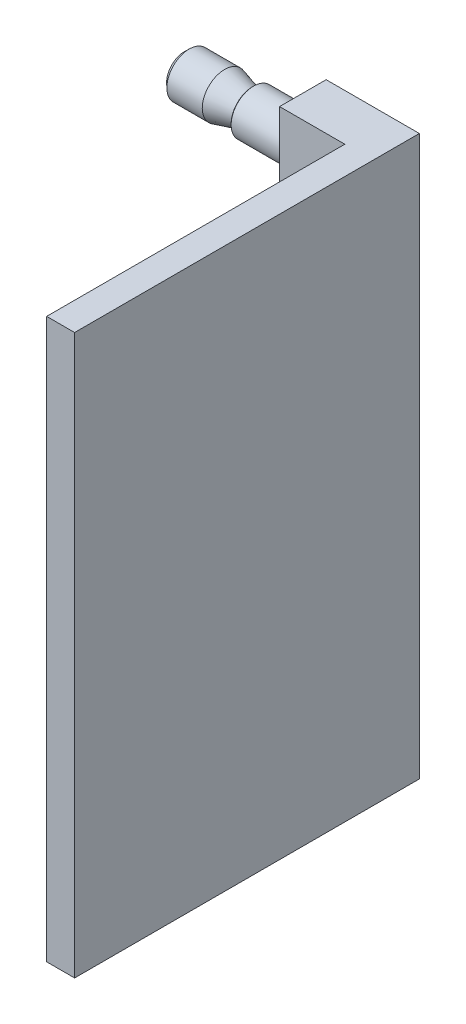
ISO-10303-21;
HEADER;
FILE_DESCRIPTION(('STEP AP214'),'2;1');
FILE_NAME('part.step','',(''),(''),'','','');
FILE_SCHEMA(('AUTOMOTIVE_DESIGN { 1 0 10303 214 1 1 1 1 }'));
ENDSEC;
DATA;
#1=APPLICATION_CONTEXT('core data for automotive mechanical design processes');
#2=APPLICATION_PROTOCOL_DEFINITION('international standard','automotive_design',2000,#1);
#3=PRODUCT_CONTEXT('',#1,'mechanical');
#4=PRODUCT('Part','Part','',(#3));
#5=PRODUCT_RELATED_PRODUCT_CATEGORY('part','',(#4));
#6=PRODUCT_DEFINITION_FORMATION('','',#4);
#7=PRODUCT_DEFINITION_CONTEXT('part definition',#1,'design');
#8=PRODUCT_DEFINITION('design','',#6,#7);
#9=PRODUCT_DEFINITION_SHAPE('','',#8);
#10=(LENGTH_UNIT() NAMED_UNIT(*) SI_UNIT(.MILLI.,.METRE.));
#11=(NAMED_UNIT(*) PLANE_ANGLE_UNIT() SI_UNIT($,.RADIAN.));
#12=(NAMED_UNIT(*) SI_UNIT($,.STERADIAN.) SOLID_ANGLE_UNIT());
#13=UNCERTAINTY_MEASURE_WITH_UNIT(LENGTH_MEASURE(1.E-05),#10,'distance_accuracy_value','');
#14=(GEOMETRIC_REPRESENTATION_CONTEXT(3) GLOBAL_UNCERTAINTY_ASSIGNED_CONTEXT((#13)) GLOBAL_UNIT_ASSIGNED_CONTEXT((#10,
#11,#12)) REPRESENTATION_CONTEXT('',''));
#15=CARTESIAN_POINT('',(0.,0.,0.));
#16=DIRECTION('',(0.,0.,1.));
#17=DIRECTION('',(1.,0.,0.));
#18=AXIS2_PLACEMENT_3D('',#15,#16,#17);
#19=CARTESIAN_POINT('',(-23.3077026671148,25.,1.90021068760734));
#20=DIRECTION('',(1.,0.,0.));
#21=DIRECTION('',(0.,1.,0.));
#22=AXIS2_PLACEMENT_3D('',#19,#20,#21);
#23=CONICAL_SURFACE('',#22,1.91884038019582,0.760039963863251);
#24=CARTESIAN_POINT('',(-20.8439243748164,21.1864694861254,0.));
#25=CARTESIAN_POINT('',(-20.9254013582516,21.2730100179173,0.));
#26=CARTESIAN_POINT('',(-21.0065991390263,21.3598157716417,0.));
#27=CARTESIAN_POINT('',(-21.1682881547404,21.5340975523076,0.));
#28=CARTESIAN_POINT('',(-21.2487793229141,21.6215736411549,0.));
#29=CARTESIAN_POINT('',(-21.4091962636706,21.7976541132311,0.));
#30=CARTESIAN_POINT('',(-21.4891187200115,21.8862615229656,0.));
#31=CARTESIAN_POINT('',(-21.6478597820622,22.0644545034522,0.));
#32=CARTESIAN_POINT('',(-21.7266784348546,22.1540400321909,0.));
#33=CARTESIAN_POINT('',(-21.8871965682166,22.3393718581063,0.));
#34=CARTESIAN_POINT('',(-21.9688171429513,22.4351866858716,0.));
#35=CARTESIAN_POINT('',(-22.1299954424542,22.6285343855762,0.));
#36=CARTESIAN_POINT('',(-22.2095532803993,22.7260671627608,0.));
#37=CARTESIAN_POINT('',(-22.365752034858,22.9232068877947,0.));
#38=CARTESIAN_POINT('',(-22.4423972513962,23.0228104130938,0.));
#39=CARTESIAN_POINT('',(-22.5917758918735,23.2248944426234,0.));
#40=CARTESIAN_POINT('',(-22.6645105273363,23.3273740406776,0.));
#41=CARTESIAN_POINT('',(-22.7835845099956,23.5052016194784,0.));
#42=CARTESIAN_POINT('',(-22.8313561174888,23.5795855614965,0.));
#43=CARTESIAN_POINT('',(-22.923184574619,23.7306697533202,0.));
#44=CARTESIAN_POINT('',(-22.9672400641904,23.80737083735,0.));
#45=CARTESIAN_POINT('',(-23.0500229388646,23.9629040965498,0.));
#46=CARTESIAN_POINT('',(-23.0887877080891,24.0417160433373,0.));
#47=CARTESIAN_POINT('',(-23.1596307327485,24.2022431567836,0.));
#48=CARTESIAN_POINT('',(-23.1917140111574,24.2839560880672,0.));
#49=CARTESIAN_POINT('',(-23.2542816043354,24.4723127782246,0.));
#50=CARTESIAN_POINT('',(-23.2821504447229,24.5798849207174,0.));
#51=CARTESIAN_POINT('',(-23.3099543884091,24.7434001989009,0.));
#52=CARTESIAN_POINT('',(-23.3168891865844,24.7981871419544,0.));
#53=CARTESIAN_POINT('',(-23.3257982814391,24.9081756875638,0.));
#54=CARTESIAN_POINT('',(-23.3277727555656,24.9633772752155,0.));
#55=CARTESIAN_POINT('',(-23.3266393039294,25.0738598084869,0.));
#56=CARTESIAN_POINT('',(-23.3235190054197,25.1291406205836,0.));
#57=CARTESIAN_POINT('',(-23.312350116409,25.2391973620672,0.));
#58=CARTESIAN_POINT('',(-23.3043012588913,25.2939732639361,0.));
#59=CARTESIAN_POINT('',(-23.2836509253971,25.4028483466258,0.));
#60=CARTESIAN_POINT('',(-23.2710335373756,25.4569444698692,0.));
#61=CARTESIAN_POINT('',(-23.2418035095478,25.564034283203,0.));
#62=CARTESIAN_POINT('',(-23.2251905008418,25.6170278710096,0.));
#63=CARTESIAN_POINT('',(-23.1677524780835,25.7813573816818,0.));
#64=CARTESIAN_POINT('',(-23.1208628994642,25.8905764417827,0.));
#65=CARTESIAN_POINT('',(-23.0165931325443,26.1038985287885,0.));
#66=CARTESIAN_POINT('',(-22.959194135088,26.2079919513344,0.));
#67=CARTESIAN_POINT('',(-22.8365194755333,26.4134252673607,0.));
#68=CARTESIAN_POINT('',(-22.7711419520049,26.514703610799,0.));
#69=CARTESIAN_POINT('',(-22.6694236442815,26.6640270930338,0.));
#70=CARTESIAN_POINT('',(-22.6349228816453,26.7133507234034,0.));
#71=CARTESIAN_POINT('',(-22.5648837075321,26.8112542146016,0.));
#72=CARTESIAN_POINT('',(-22.5293453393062,26.8598341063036,0.));
#73=CARTESIAN_POINT('',(-22.4105863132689,27.0191560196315,0.));
#74=CARTESIAN_POINT('',(-22.3255064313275,27.128511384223,0.));
#75=CARTESIAN_POINT('',(-22.1521769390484,27.3446890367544,0.));
#76=CARTESIAN_POINT('',(-22.0639267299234,27.4515108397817,0.));
#77=CARTESIAN_POINT('',(-21.8850948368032,27.6632831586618,0.));
#78=CARTESIAN_POINT('',(-21.7945118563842,27.7682325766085,0.));
#79=CARTESIAN_POINT('',(-21.6116434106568,27.9766402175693,0.));
#80=CARTESIAN_POINT('',(-21.5193578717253,28.0800983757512,0.));
#81=CARTESIAN_POINT('',(-21.2400907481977,28.3892770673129,0.));
#82=CARTESIAN_POINT('',(-21.0511745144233,28.5932478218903,0.));
#83=CARTESIAN_POINT('',(-20.6702555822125,28.9981334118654,0.));
#84=CARTESIAN_POINT('',(-20.4782539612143,29.1990492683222,0.));
#85=CARTESIAN_POINT('',(-20.1157618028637,29.5743769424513,0.));
#86=CARTESIAN_POINT('',(-19.945513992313,29.7490235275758,0.));
#87=CARTESIAN_POINT('',(-19.6038155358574,30.0971696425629,0.));
#88=CARTESIAN_POINT('',(-19.4323647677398,30.2706690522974,0.));
#89=CARTESIAN_POINT('',(-19.0894315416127,30.6159266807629,0.));
#90=CARTESIAN_POINT('',(-18.9179534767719,30.7876892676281,0.));
#91=CARTESIAN_POINT('',(-18.5743310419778,31.1305045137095,0.));
#92=CARTESIAN_POINT('',(-18.4021867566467,31.3015572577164,0.));
#93=CARTESIAN_POINT('',(-18.2297937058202,31.4723573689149,0.));
#94=B_SPLINE_CURVE_WITH_KNOTS('',3,(#24,#25,#26,#27,#28,#29,#30,#31,#32,#33,#34,#35,#36,#37,#38,
#39,#40,#41,#42,#43,#44,#45,#46,#47,#48,#49,#50,#51,#52,#53,#54,#55,#56,#57,#58,#59,#60,#61,#62,
#63,#64,#65,#66,#67,#68,#69,#70,#71,#72,#73,#74,#75,#76,#77,#78,#79,#80,#81,#82,#83,#84,#85,#86,
#87,#88,#89,#90,#91,#92,#93),.UNSPECIFIED.,.F.,.F.,(4,2,2,2,2,2,2,2,2,2,2,2,2,2,2,2,2,2,2,2,2,2,
2,2,2,2,2,2,2,2,2,2,2,2,4),(0.,0.356582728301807,0.713198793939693,1.07117165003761,
1.42912919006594,1.80670775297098,2.1842655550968,2.56124239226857,2.93810175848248,
3.20322959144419,3.46845404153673,3.7316949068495,3.99473715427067,4.32661386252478,
4.49209272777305,4.6575656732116,4.82344107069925,4.989325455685,5.15579325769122,
5.32227643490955,5.67789990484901,6.03416618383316,6.39558215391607,6.57615089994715,
6.75671212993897,7.1722768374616,7.58792045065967,8.00380026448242,8.41969810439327,
9.25368397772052,10.0873846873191,10.8190678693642,11.5508264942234,12.2789479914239,
13.006979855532),.UNSPECIFIED.);
#95=CARTESIAN_POINT('',(-22.8013790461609,23.5337970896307,0.));
#96=VERTEX_POINT('',#95);
#97=CARTESIAN_POINT('',(-23.3077026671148,24.7332646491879,0.));
#98=VERTEX_POINT('',#97);
#99=EDGE_CURVE('E43',#96,#98,#94,.T.);
#100=ORIENTED_EDGE('',*,*,#99,.F.);
#101=CARTESIAN_POINT('',(-22.8013790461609,25.,1.90021068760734));
#102=DIRECTION('',(1.,0.,0.));
#103=DIRECTION('',(0.,1.,0.));
#104=AXIS2_PLACEMENT_3D('',#101,#102,#103);
#105=CIRCLE('',#104,2.40011492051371);
#106=CARTESIAN_POINT('',(-22.8013790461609,26.4662029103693,0.));
#107=VERTEX_POINT('',#106);
#108=EDGE_CURVE('E281',#107,#96,#105,.T.);
#109=ORIENTED_EDGE('',*,*,#108,.F.);
#110=CARTESIAN_POINT('',(-23.3077026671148,25.2667353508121,0.));
#111=VERTEX_POINT('',#110);
#112=EDGE_CURVE('E467',#111,#107,#94,.T.);
#113=ORIENTED_EDGE('',*,*,#112,.F.);
#114=CARTESIAN_POINT('',(-23.3077026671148,25.,1.90021068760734));
#115=DIRECTION('',(1.,0.,0.));
#116=DIRECTION('',(0.,1.,0.));
#117=AXIS2_PLACEMENT_3D('',#114,#115,#116);
#118=CIRCLE('',#117,1.91884038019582);
#119=EDGE_CURVE('E238',#111,#98,#118,.T.);
#120=ORIENTED_EDGE('',*,*,#119,.T.);
#121=EDGE_LOOP('',(#100,#109,#113,#120));
#122=FACE_BOUND('',#121,.T.);
#123=ADVANCED_FACE('F14',(#122),#23,.T.);
#124=CARTESIAN_POINT('',(-10.0009576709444,25.,1.90021068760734));
#125=DIRECTION('',(1.,0.,0.));
#126=DIRECTION('',(0.,1.,0.));
#127=AXIS2_PLACEMENT_3D('',#124,#125,#126);
#128=CYLINDRICAL_SURFACE('',#127,2.40011492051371);
#129=DIRECTION('',(1.,0.,0.));
#130=VECTOR('',#129,1.);
#131=CARTESIAN_POINT('',(-10.0009576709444,26.4662029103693,0.));
#132=LINE('',#131,#130);
#133=CARTESIAN_POINT('',(-19.0015322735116,26.4662029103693,0.));
#134=VERTEX_POINT('',#133);
#135=EDGE_CURVE('E887',#107,#134,#132,.T.);
#136=ORIENTED_EDGE('',*,*,#135,.F.);
#137=ORIENTED_EDGE('',*,*,#108,.T.);
#138=DIRECTION('',(1.,0.,0.));
#139=VECTOR('',#138,1.);
#140=CARTESIAN_POINT('',(-10.0009576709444,23.5337970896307,0.));
#141=LINE('',#140,#139);
#142=CARTESIAN_POINT('',(-19.0015322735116,23.5337970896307,0.));
#143=VERTEX_POINT('',#142);
#144=EDGE_CURVE('E890',#143,#96,#141,.F.);
#145=ORIENTED_EDGE('',*,*,#144,.F.);
#146=CARTESIAN_POINT('',(-19.0015322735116,25.,1.90021068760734));
#147=DIRECTION('',(1.,0.,0.));
#148=DIRECTION('',(0.,1.,0.));
#149=AXIS2_PLACEMENT_3D('',#146,#147,#148);
#150=CIRCLE('',#149,2.40011492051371);
#151=EDGE_CURVE('E278',#134,#143,#150,.T.);
#152=ORIENTED_EDGE('',*,*,#151,.F.);
#153=EDGE_LOOP('',(#136,#137,#145,#152));
#154=FACE_BOUND('',#153,.T.);
#155=ADVANCED_FACE('F515',(#154),#128,.T.);
#156=CARTESIAN_POINT('',(-19.0015322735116,25.,1.90021068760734));
#157=DIRECTION('',(-1.,0.,0.));
#158=DIRECTION('',(0.,-1.,0.));
#159=AXIS2_PLACEMENT_3D('',#156,#157,#158);
#160=CONICAL_SURFACE('',#159,2.40011492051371,0.261760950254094);
#161=CARTESIAN_POINT('',(-16.3784715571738,25.,1.90021068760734));
#162=DIRECTION('',(1.,0.,0.));
#163=DIRECTION('',(0.,1.,0.));
#164=AXIS2_PLACEMENT_3D('',#161,#162,#163);
#165=CIRCLE('',#164,1.69737598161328);
#166=CARTESIAN_POINT('',(-16.3784715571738,26.6973759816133,1.90021068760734));
#167=VERTEX_POINT('',#166);
#168=EDGE_CURVE('E275',#167,#167,#165,.T.);
#169=ORIENTED_EDGE('',*,*,#168,.F.);
#170=EDGE_LOOP('',(#169));
#171=FACE_BOUND('',#170,.T.);
#172=CARTESIAN_POINT('',(-21.9498762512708,22.4377161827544,0.));
#173=CARTESIAN_POINT('',(-21.8062573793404,22.4856277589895,0.));
#174=CARTESIAN_POINT('',(-21.6627751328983,22.5339535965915,0.));
#175=CARTESIAN_POINT('',(-21.3761477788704,22.6316250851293,0.));
#176=CARTESIAN_POINT('',(-21.2330026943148,22.6809708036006,0.));
#177=CARTESIAN_POINT('',(-20.9467982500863,22.7809838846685,0.));
#178=CARTESIAN_POINT('',(-20.803739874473,22.8316540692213,0.));
#179=CARTESIAN_POINT('',(-20.5181567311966,22.934465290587,0.));
#180=CARTESIAN_POINT('',(-20.3756319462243,22.9866062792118,0.));
#181=CARTESIAN_POINT('',(-20.0913111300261,23.0926896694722,0.));
#182=CARTESIAN_POINT('',(-19.9495148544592,23.1466314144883,0.));
#183=CARTESIAN_POINT('',(-19.666819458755,23.2568144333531,0.));
#184=CARTESIAN_POINT('',(-19.525920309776,23.3130556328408,0.));
#185=CARTESIAN_POINT('',(-19.2454807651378,23.4284834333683,0.));
#186=CARTESIAN_POINT('',(-19.105939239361,23.487667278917,0.));
#187=CARTESIAN_POINT('',(-18.8286407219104,23.6100585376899,0.));
#188=CARTESIAN_POINT('',(-18.6908833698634,23.6732651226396,0.));
#189=CARTESIAN_POINT('',(-18.5028690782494,23.7643878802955,0.));
#190=CARTESIAN_POINT('',(-18.4514168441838,23.7898352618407,0.));
#191=CARTESIAN_POINT('',(-18.3490065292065,23.8417108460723,0.));
#192=CARTESIAN_POINT('',(-18.2980484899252,23.8681391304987,0.));
#193=CARTESIAN_POINT('',(-18.1457640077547,23.9492876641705,0.));
#194=CARTESIAN_POINT('',(-18.0453268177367,24.0057287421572,0.));
#195=CARTESIAN_POINT('',(-17.8979844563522,24.0951935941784,0.));
#196=CARTESIAN_POINT('',(-17.8495623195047,24.1257174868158,0.));
#197=CARTESIAN_POINT('',(-17.7540768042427,24.1888121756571,0.));
#198=CARTESIAN_POINT('',(-17.7070130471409,24.2213823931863,0.));
#199=CARTESIAN_POINT('',(-17.6149422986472,24.2889782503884,0.));
#200=CARTESIAN_POINT('',(-17.5699281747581,24.3239940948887,0.));
#201=CARTESIAN_POINT('',(-17.4826710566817,24.3972933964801,0.));
#202=CARTESIAN_POINT('',(-17.4404248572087,24.4355729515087,0.));
#203=CARTESIAN_POINT('',(-17.3716198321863,24.5049212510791,0.));
#204=CARTESIAN_POINT('',(-17.3440170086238,24.5349437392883,0.));
#205=CARTESIAN_POINT('',(-17.2918987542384,24.5976912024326,0.));
#206=CARTESIAN_POINT('',(-17.267388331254,24.6304204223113,0.));
#207=CARTESIAN_POINT('',(-17.2226371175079,24.6994074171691,0.));
#208=CARTESIAN_POINT('',(-17.2024603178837,24.7357078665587,0.));
#209=CARTESIAN_POINT('',(-17.1690802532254,24.8113664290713,0.));
#210=CARTESIAN_POINT('',(-17.1558486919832,24.8507113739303,0.));
#211=CARTESIAN_POINT('',(-17.1410774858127,24.9198153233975,0.));
#212=CARTESIAN_POINT('',(-17.1372728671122,24.9490870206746,0.));
#213=CARTESIAN_POINT('',(-17.134792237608,25.0078574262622,0.));
#214=CARTESIAN_POINT('',(-17.1361158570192,25.0373561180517,0.));
#215=CARTESIAN_POINT('',(-17.1437164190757,25.0955935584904,0.));
#216=CARTESIAN_POINT('',(-17.149977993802,25.1243343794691,0.));
#217=CARTESIAN_POINT('',(-17.1667447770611,25.1805268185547,0.));
#218=CARTESIAN_POINT('',(-17.1772522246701,25.207977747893,0.));
#219=CARTESIAN_POINT('',(-17.2094963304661,25.2784775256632,0.));
#220=CARTESIAN_POINT('',(-17.2341080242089,25.3201972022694,0.));
#221=CARTESIAN_POINT('',(-17.2892193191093,25.3995735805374,0.));
#222=CARTESIAN_POINT('',(-17.3197421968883,25.4372132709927,0.));
#223=CARTESIAN_POINT('',(-17.396476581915,25.5223080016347,0.));
#224=CARTESIAN_POINT('',(-17.4443232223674,25.5682652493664,0.));
#225=CARTESIAN_POINT('',(-17.5441500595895,25.6555100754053,0.));
#226=CARTESIAN_POINT('',(-17.5961392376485,25.6967870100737,0.));
#227=CARTESIAN_POINT('',(-17.7033755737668,25.7762983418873,0.));
#228=CARTESIAN_POINT('',(-17.7586552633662,25.8144884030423,0.));
#229=CARTESIAN_POINT('',(-17.8709386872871,25.8880613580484,0.));
#230=CARTESIAN_POINT('',(-17.9279403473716,25.9234474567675,0.));
#231=CARTESIAN_POINT('',(-18.0530263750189,25.9979044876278,0.));
#232=CARTESIAN_POINT('',(-18.1213461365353,26.0365778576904,0.));
#233=CARTESIAN_POINT('',(-18.2592331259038,26.1116425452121,0.));
#234=CARTESIAN_POINT('',(-18.3288005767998,26.1480334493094,0.));
#235=CARTESIAN_POINT('',(-18.5389578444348,26.2545488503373,0.));
#236=CARTESIAN_POINT('',(-18.680916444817,26.321966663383,0.));
#237=CARTESIAN_POINT('',(-18.9675191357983,26.4521837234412,0.));
#238=CARTESIAN_POINT('',(-19.1121711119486,26.5149652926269,0.));
#239=CARTESIAN_POINT('',(-19.4028969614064,26.6369726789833,0.));
#240=CARTESIAN_POINT('',(-19.548970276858,26.6961998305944,0.));
#241=CARTESIAN_POINT('',(-19.8250286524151,26.805232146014,0.));
#242=CARTESIAN_POINT('',(-19.9548990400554,26.8553295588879,0.));
#243=CARTESIAN_POINT('',(-20.2152820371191,26.9538693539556,0.));
#244=CARTESIAN_POINT('',(-20.3457947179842,27.0023115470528,0.));
#245=CARTESIAN_POINT('',(-20.6063787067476,27.0975020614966,0.));
#246=CARTESIAN_POINT('',(-20.7364465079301,27.1442600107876,0.));
#247=CARTESIAN_POINT('',(-20.9969575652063,27.2366487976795,0.));
#248=CARTESIAN_POINT('',(-21.1274007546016,27.2822798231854,0.));
#249=CARTESIAN_POINT('',(-21.2579983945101,27.3274583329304,0.));
#250=B_SPLINE_CURVE_WITH_KNOTS('',3,(#172,#173,#174,#175,#176,#177,#178,#179,#180,#181,#182,
#183,#184,#185,#186,#187,#188,#189,#190,#191,#192,#193,#194,#195,#196,#197,#198,#199,#200,#201,
#202,#203,#204,#205,#206,#207,#208,#209,#210,#211,#212,#213,#214,#215,#216,#217,#218,#219,#220,
#221,#222,#223,#224,#225,#226,#227,#228,#229,#230,#231,#232,#233,#234,#235,#236,#237,#238,#239,
#240,#241,#242,#243,#244,#245,#246,#247,#248,#249),.UNSPECIFIED.,.F.,.F.,(4,2,2,2,2,2,2,2,2,2,2,
2,2,2,2,2,2,2,2,2,2,2,2,2,2,2,2,2,2,2,2,2,2,2,2,2,2,2,4),(0.,0.454201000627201,
0.908432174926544,1.36372604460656,1.81900501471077,2.2741197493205,2.72921977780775,
3.1839013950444,3.63848969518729,3.8106831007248,3.98289088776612,4.328301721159,
4.49998452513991,4.67161899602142,4.84260162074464,5.01338261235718,5.13558373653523,
5.25798028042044,5.38207585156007,5.50566183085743,5.59380081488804,5.68193344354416,
5.7697928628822,5.85769867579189,6.00216838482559,6.14721898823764,6.34574962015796,
6.54472304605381,6.7461765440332,6.9473963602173,7.18285547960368,7.41835711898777,
7.88965781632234,8.36267155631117,8.83550658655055,9.25308792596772,9.67071681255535,
10.0853624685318,10.4999385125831),.UNSPECIFIED.);
#251=EDGE_CURVE('E366',#134,#143,#250,.F.);
#252=ORIENTED_EDGE('',*,*,#251,.F.);
#253=ORIENTED_EDGE('',*,*,#151,.T.);
#254=EDGE_LOOP('',(#252,#253));
#255=FACE_BOUND('',#254,.T.);
#256=ADVANCED_FACE('F521',(#171,#255),#160,.T.);
#257=CARTESIAN_POINT('',(-16.0245522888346,25.,1.90021068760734));
#258=DIRECTION('',(1.,0.,0.));
#259=DIRECTION('',(0.,1.,0.));
#260=AXIS2_PLACEMENT_3D('',#257,#258,#259);
#261=CONICAL_SURFACE('',#260,1.87029544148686,1.37127084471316);
#262=CARTESIAN_POINT('',(-16.0245522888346,25.,1.90021068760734));
#263=DIRECTION('',(1.,0.,0.));
#264=DIRECTION('',(0.,1.,0.));
#265=AXIS2_PLACEMENT_3D('',#262,#263,#264);
#266=CIRCLE('',#265,1.87029544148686);
#267=CARTESIAN_POINT('',(-16.0245522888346,26.8702954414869,1.90021068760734));
#268=VERTEX_POINT('',#267);
#269=EDGE_CURVE('E263',#268,#268,#266,.T.);
#270=ORIENTED_EDGE('',*,*,#269,.T.);
#271=EDGE_LOOP('',(#270));
#272=FACE_BOUND('',#271,.T.);
#273=CARTESIAN_POINT('',(-15.7201397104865,22.2099457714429,0.));
#274=CARTESIAN_POINT('',(-15.7343595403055,22.2950400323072,0.));
#275=CARTESIAN_POINT('',(-15.7483839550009,22.3801669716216,0.));
#276=CARTESIAN_POINT('',(-15.7759443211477,22.5505023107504,0.));
#277=CARTESIAN_POINT('',(-15.7894802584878,22.6357107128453,0.));
#278=CARTESIAN_POINT('',(-15.8292311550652,22.8916260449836,0.));
#279=CARTESIAN_POINT('',(-15.8545636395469,23.0624722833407,0.));
#280=CARTESIAN_POINT('',(-15.9015214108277,23.4035377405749,0.));
#281=CARTESIAN_POINT('',(-15.923170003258,23.5737536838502,0.));
#282=CARTESIAN_POINT('',(-15.9611839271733,23.9147313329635,0.));
#283=CARTESIAN_POINT('',(-15.9775511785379,24.0854928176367,0.));
#284=CARTESIAN_POINT('',(-16.0027913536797,24.4284508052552,0.));
#285=CARTESIAN_POINT('',(-16.0116272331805,24.600650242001,0.));
#286=CARTESIAN_POINT('',(-16.0178415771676,24.8591291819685,0.));
#287=CARTESIAN_POINT('',(-16.0187394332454,24.9453301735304,0.));
#288=CARTESIAN_POINT('',(-16.0181606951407,25.1177225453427,0.));
#289=CARTESIAN_POINT('',(-16.0166841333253,25.2039139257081,0.));
#290=CARTESIAN_POINT('',(-16.0087556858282,25.4634017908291,0.));
#291=CARTESIAN_POINT('',(-15.9987814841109,25.6365982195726,0.));
#292=CARTESIAN_POINT('',(-15.9782444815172,25.895920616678,0.));
#293=CARTESIAN_POINT('',(-15.9704685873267,25.9822903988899,0.));
#294=CARTESIAN_POINT('',(-15.9533580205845,26.1548597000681,0.));
#295=CARTESIAN_POINT('',(-15.9440236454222,26.2410592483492,0.));
#296=CARTESIAN_POINT('',(-15.9340584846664,26.3271863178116,0.));
#297=B_SPLINE_CURVE_WITH_KNOTS('',3,(#273,#274,#275,#276,#277,#278,#279,#280,#281,#282,#283,
#284,#285,#286,#287,#288,#289,#290,#291,#292,#293,#294,#295,#296),.UNSPECIFIED.,.F.,.F.,(4,2,2,
2,2,2,2,2,2,2,2,4),(0.,0.258822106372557,0.517651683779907,1.0357697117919,1.55047712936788,
2.06499722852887,2.5820337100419,2.84062016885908,3.09920310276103,3.61940692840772,
3.87955530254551,4.13965409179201),.UNSPECIFIED.);
#298=CARTESIAN_POINT('',(-16.0009576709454,24.4192490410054,0.));
#299=VERTEX_POINT('',#298);
#300=CARTESIAN_POINT('',(-16.0009576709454,25.5807509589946,0.));
#301=VERTEX_POINT('',#300);
#302=EDGE_CURVE('E383',#299,#301,#297,.T.);
#303=ORIENTED_EDGE('',*,*,#302,.F.);
#304=CARTESIAN_POINT('',(-16.0009576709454,25.,1.90021068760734));
#305=DIRECTION('',(1.,0.,0.));
#306=DIRECTION('',(0.,1.,0.));
#307=AXIS2_PLACEMENT_3D('',#304,#305,#306);
#308=CIRCLE('',#307,1.98697567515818);
#309=EDGE_CURVE('E260',#301,#299,#308,.T.);
#310=ORIENTED_EDGE('',*,*,#309,.F.);
#311=EDGE_LOOP('',(#303,#310));
#312=FACE_BOUND('',#311,.T.);
#313=ADVANCED_FACE('F504',(#272,#312),#261,.T.);
#314=CARTESIAN_POINT('',(-16.0009576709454,25.,3.88718636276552));
#315=DIRECTION('',(1.,0.,0.));
#316=DIRECTION('',(0.,1.,0.));
#317=AXIS2_PLACEMENT_3D('',#314,#315,#316);
#318=PLANE('',#317);
#319=DIRECTION('',(0.,1.,0.));
#320=VECTOR('',#319,1.);
#321=CARTESIAN_POINT('',(-16.0009576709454,25.,0.));
#322=LINE('',#321,#320);
#323=CARTESIAN_POINT('',(-16.0009576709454,23.703922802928,0.));
#324=VERTEX_POINT('',#323);
#325=EDGE_CURVE('E375',#324,#299,#322,.T.);
#326=ORIENTED_EDGE('',*,*,#325,.F.);
#327=CARTESIAN_POINT('',(-16.0009576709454,25.,1.90021068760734));
#328=DIRECTION('',(1.,0.,0.));
#329=DIRECTION('',(0.,1.,0.));
#330=AXIS2_PLACEMENT_3D('',#327,#328,#329);
#331=CIRCLE('',#330,2.30013407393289);
#332=CARTESIAN_POINT('',(-16.0009576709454,26.296077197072,0.));
#333=VERTEX_POINT('',#332);
#334=EDGE_CURVE('E257',#333,#324,#331,.T.);
#335=ORIENTED_EDGE('',*,*,#334,.F.);
#336=EDGE_CURVE('E495',#301,#333,#322,.T.);
#337=ORIENTED_EDGE('',*,*,#336,.F.);
#338=ORIENTED_EDGE('',*,*,#309,.T.);
#339=EDGE_LOOP('',(#326,#335,#337,#338));
#340=FACE_BOUND('',#339,.T.);
#341=ADVANCED_FACE('F505',(#340),#318,.F.);
#342=CARTESIAN_POINT('',(-16.0009576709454,25.,1.90021068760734));
#343=DIRECTION('',(1.,0.,0.));
#344=DIRECTION('',(0.,1.,0.));
#345=AXIS2_PLACEMENT_3D('',#342,#343,#344);
#346=CONICAL_SURFACE('',#345,2.30013407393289,0.785398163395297);
#347=CARTESIAN_POINT('',(-13.8849515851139,21.0135864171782,0.));
#348=CARTESIAN_POINT('',(-13.9688770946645,21.1065728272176,0.));
#349=CARTESIAN_POINT('',(-14.0525174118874,21.1998189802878,0.));
#350=CARTESIAN_POINT('',(-14.2190693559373,21.3869739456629,0.));
#351=CARTESIAN_POINT('',(-14.3019809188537,21.4808828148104,0.));
#352=CARTESIAN_POINT('',(-14.4671066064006,21.6697238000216,0.));
#353=CARTESIAN_POINT('',(-14.5493184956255,21.7646578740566,0.));
#354=CARTESIAN_POINT('',(-14.7125943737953,21.9555037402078,0.));
#355=CARTESIAN_POINT('',(-14.793658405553,22.0514154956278,0.));
#356=CARTESIAN_POINT('',(-14.9528778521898,22.2427368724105,0.));
#357=CARTESIAN_POINT('',(-15.0310593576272,22.3381247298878,0.));
#358=CARTESIAN_POINT('',(-15.1855668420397,22.5303901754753,0.));
#359=CARTESIAN_POINT('',(-15.2618929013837,22.6272676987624,0.));
#360=CARTESIAN_POINT('',(-15.4120226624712,22.822879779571,0.));
#361=CARTESIAN_POINT('',(-15.4858277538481,22.9216132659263,0.));
#362=CARTESIAN_POINT('',(-15.6300199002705,23.1215346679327,0.));
#363=CARTESIAN_POINT('',(-15.7004076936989,23.2227220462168,0.));
#364=CARTESIAN_POINT('',(-15.8228419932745,23.4079152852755,0.));
#365=CARTESIAN_POINT('',(-15.8757555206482,23.4913439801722,0.));
#366=CARTESIAN_POINT('',(-15.9772989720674,23.6606701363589,0.));
#367=CARTESIAN_POINT('',(-16.0259333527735,23.746564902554,0.));
#368=CARTESIAN_POINT('',(-16.1177163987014,23.9220576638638,0.));
#369=CARTESIAN_POINT('',(-16.1608251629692,24.0116770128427,0.));
#370=CARTESIAN_POINT('',(-16.2193958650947,24.1489010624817,0.));
#371=CARTESIAN_POINT('',(-16.237931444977,24.1951928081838,0.));
#372=CARTESIAN_POINT('',(-16.2725833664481,24.2887102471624,0.));
#373=CARTESIAN_POINT('',(-16.2886978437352,24.3359366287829,0.));
#374=CARTESIAN_POINT('',(-16.3034118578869,24.3836200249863,0.));
#375=B_SPLINE_CURVE_WITH_KNOTS('',3,(#347,#348,#349,#350,#351,#352,#353,#354,#355,#356,#357,
#358,#359,#360,#361,#362,#363,#364,#365,#366,#367,#368,#369,#370,#371,#372,#373,#374),
.UNSPECIFIED.,.F.,.F.,(4,2,2,2,2,2,2,2,2,2,2,2,2,4),(0.,0.375780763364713,0.75159415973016,
1.12833815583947,1.50506806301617,1.87505180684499,2.24501949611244,2.61477984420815,
2.98445993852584,3.28074749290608,3.57672272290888,3.8747273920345,4.02426084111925,
4.17390885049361),.UNSPECIFIED.);
#376=CARTESIAN_POINT('',(-15.900976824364,23.5337970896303,0.));
#377=VERTEX_POINT('',#376);
#378=EDGE_CURVE('E374',#377,#324,#375,.T.);
#379=ORIENTED_EDGE('',*,*,#378,.F.);
#380=CARTESIAN_POINT('',(-15.9009768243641,25.,1.90021068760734));
#381=DIRECTION('',(1.,0.,0.));
#382=DIRECTION('',(0.,1.,0.));
#383=AXIS2_PLACEMENT_3D('',#380,#381,#382);
#384=CIRCLE('',#383,2.40011492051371);
#385=CARTESIAN_POINT('',(-15.9009768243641,26.4662029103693,0.));
#386=VERTEX_POINT('',#385);
#387=EDGE_CURVE('E254',#386,#377,#384,.T.);
#388=ORIENTED_EDGE('',*,*,#387,.F.);
#389=CARTESIAN_POINT('',(-16.3034118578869,25.6163799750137,0.));
#390=CARTESIAN_POINT('',(-16.2886978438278,25.6640633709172,0.));
#391=CARTESIAN_POINT('',(-16.2725833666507,25.7112897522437,0.));
#392=CARTESIAN_POINT('',(-16.2379314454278,25.8048071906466,0.));
#393=CARTESIAN_POINT('',(-16.2193958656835,25.8510989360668,0.));
#394=CARTESIAN_POINT('',(-16.1608251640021,25.9883229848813,0.));
#395=CARTESIAN_POINT('',(-16.1177164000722,26.0779423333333,0.));
#396=CARTESIAN_POINT('',(-16.0259333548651,26.2534350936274,0.));
#397=CARTESIAN_POINT('',(-15.9772989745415,26.3393298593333,0.));
#398=CARTESIAN_POINT('',(-15.8757555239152,26.5086560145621,0.));
#399=CARTESIAN_POINT('',(-15.8228419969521,26.5920847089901,0.));
#400=CARTESIAN_POINT('',(-15.7004076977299,26.7772779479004,0.));
#401=CARTESIAN_POINT('',(-15.6300199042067,26.8784653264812,0.));
#402=CARTESIAN_POINT('',(-15.4858277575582,27.078386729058,0.));
#403=CARTESIAN_POINT('',(-15.4120226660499,27.177120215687,0.));
#404=CARTESIAN_POINT('',(-15.2618929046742,27.3727322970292,0.));
#405=CARTESIAN_POINT('',(-15.1855668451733,27.4696098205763,0.));
#406=CARTESIAN_POINT('',(-15.0310593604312,27.6618752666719,0.));
#407=CARTESIAN_POINT('',(-14.9528778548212,27.7572631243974,0.));
#408=CARTESIAN_POINT('',(-14.7936584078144,27.9485845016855,0.));
#409=CARTESIAN_POINT('',(-14.712594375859,28.0444962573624,0.));
#410=CARTESIAN_POINT('',(-14.5493184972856,28.2353421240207,0.));
#411=CARTESIAN_POINT('',(-14.4671066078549,28.330276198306,0.));
#412=CARTESIAN_POINT('',(-14.3019809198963,28.5191171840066,0.));
#413=CARTESIAN_POINT('',(-14.219069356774,28.6130260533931,0.));
#414=CARTESIAN_POINT('',(-14.0525174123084,28.8001810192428,0.));
#415=CARTESIAN_POINT('',(-13.9688770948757,28.8934271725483,0.));
#416=CARTESIAN_POINT('',(-13.8849515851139,28.9864135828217,0.));
#417=B_SPLINE_CURVE_WITH_KNOTS('',3,(#389,#390,#391,#392,#393,#394,#395,#396,#397,#398,#399,
#400,#401,#402,#403,#404,#405,#406,#407,#408,#409,#410,#411,#412,#413,#414,#415,#416),
.UNSPECIFIED.,.F.,.F.,(4,2,2,2,2,2,2,2,2,2,2,2,2,4),(0.,0.149648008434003,0.299181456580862,
0.597186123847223,0.893161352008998,1.18944890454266,1.55912899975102,1.92888934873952,
2.29885703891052,2.66884078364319,3.04557069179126,3.42231468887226,3.79812808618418,
4.1739088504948),.UNSPECIFIED.);
#418=EDGE_CURVE('E490',#333,#386,#417,.T.);
#419=ORIENTED_EDGE('',*,*,#418,.F.);
#420=ORIENTED_EDGE('',*,*,#334,.T.);
#421=EDGE_LOOP('',(#379,#388,#419,#420));
#422=FACE_BOUND('',#421,.T.);
#423=ADVANCED_FACE('F390',(#422),#346,.T.);
#424=CARTESIAN_POINT('',(-10.0009576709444,25.,1.90021068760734));
#425=DIRECTION('',(1.,0.,0.));
#426=DIRECTION('',(0.,1.,0.));
#427=AXIS2_PLACEMENT_3D('',#424,#425,#426);
#428=CYLINDRICAL_SURFACE('',#427,2.40011492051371);
#429=DIRECTION('',(1.,0.,0.));
#430=VECTOR('',#429,1.);
#431=CARTESIAN_POINT('',(-10.0009576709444,26.4662029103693,0.));
#432=LINE('',#431,#430);
#433=CARTESIAN_POINT('',(-10.1009385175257,26.4662029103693,0.));
#434=VERTEX_POINT('',#433);
#435=EDGE_CURVE('E35',#386,#434,#432,.T.);
#436=ORIENTED_EDGE('',*,*,#435,.F.);
#437=ORIENTED_EDGE('',*,*,#387,.T.);
#438=DIRECTION('',(1.,0.,0.));
#439=VECTOR('',#438,1.);
#440=CARTESIAN_POINT('',(-10.0009576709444,23.5337970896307,0.));
#441=LINE('',#440,#439);
#442=CARTESIAN_POINT('',(-10.1009385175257,23.5337970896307,0.));
#443=VERTEX_POINT('',#442);
#444=EDGE_CURVE('E196',#443,#377,#441,.F.);
#445=ORIENTED_EDGE('',*,*,#444,.F.);
#446=CARTESIAN_POINT('',(-10.1009385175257,25.,1.90021068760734));
#447=DIRECTION('',(1.,0.,0.));
#448=DIRECTION('',(0.,1.,0.));
#449=AXIS2_PLACEMENT_3D('',#446,#447,#448);
#450=CIRCLE('',#449,2.40011492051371);
#451=EDGE_CURVE('E247',#434,#443,#450,.T.);
#452=ORIENTED_EDGE('',*,*,#451,.F.);
#453=EDGE_LOOP('',(#436,#437,#445,#452));
#454=FACE_BOUND('',#453,.T.);
#455=ADVANCED_FACE('F372',(#454),#428,.T.);
#456=CARTESIAN_POINT('',(-10.1009385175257,25.,1.90021068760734));
#457=DIRECTION('',(-1.,0.,0.));
#458=DIRECTION('',(0.,-1.,0.));
#459=AXIS2_PLACEMENT_3D('',#456,#457,#458);
#460=CONICAL_SURFACE('',#459,2.40011492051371,0.785398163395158);
#461=CARTESIAN_POINT('',(-9.6985034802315,24.3836200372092,0.));
#462=CARTESIAN_POINT('',(-9.71321749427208,24.3359366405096,0.));
#463=CARTESIAN_POINT('',(-9.72933197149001,24.2887102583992,0.));
#464=CARTESIAN_POINT('',(-9.76398389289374,24.1951928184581,0.));
#465=CARTESIAN_POINT('',(-9.78251947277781,24.1489010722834,0.));
#466=CARTESIAN_POINT('',(-9.84109017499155,24.0116770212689,0.));
#467=CARTESIAN_POINT('',(-9.88419893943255,23.9220576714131,0.));
#468=CARTESIAN_POINT('',(-9.97598198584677,23.7465649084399,0.));
#469=CARTESIAN_POINT('',(-10.024616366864,23.6606701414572,0.));
#470=CARTESIAN_POINT('',(-10.1261598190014,23.4913439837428,0.));
#471=CARTESIAN_POINT('',(-10.1790733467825,23.4079152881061,0.));
#472=CARTESIAN_POINT('',(-10.3015076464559,23.2227220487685,0.));
#473=CARTESIAN_POINT('',(-10.3718954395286,23.1215346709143,0.));
#474=CARTESIAN_POINT('',(-10.5160875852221,22.9216132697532,0.));
#475=CARTESIAN_POINT('',(-10.589892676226,22.8228797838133,0.));
#476=CARTESIAN_POINT('',(-10.7400224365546,22.6272677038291,0.));
#477=CARTESIAN_POINT('',(-10.8163484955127,22.5303901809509,0.));
#478=CARTESIAN_POINT('',(-10.9708559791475,22.3381247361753,0.));
#479=CARTESIAN_POINT('',(-11.049037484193,22.2427368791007,0.));
#480=CARTESIAN_POINT('',(-11.2082569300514,22.0514155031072,0.));
#481=CARTESIAN_POINT('',(-11.2893209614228,21.9555037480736,0.));
#482=CARTESIAN_POINT('',(-11.4525968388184,21.7646578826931,0.));
#483=CARTESIAN_POINT('',(-11.5348087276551,21.6697238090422,0.));
#484=CARTESIAN_POINT('',(-11.6999344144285,21.4808828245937,0.));
#485=CARTESIAN_POINT('',(-11.7828459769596,21.3869739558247,0.));
#486=CARTESIAN_POINT('',(-11.9493979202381,21.1998189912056,0.));
#487=CARTESIAN_POINT('',(-12.0330382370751,21.1065728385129,0.));
#488=CARTESIAN_POINT('',(-12.1169637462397,21.0135864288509,0.));
#489=B_SPLINE_CURVE_WITH_KNOTS('',3,(#461,#462,#463,#464,#465,#466,#467,#468,#469,#470,#471,
#472,#473,#474,#475,#476,#477,#478,#479,#480,#481,#482,#483,#484,#485,#486,#487,#488),
.UNSPECIFIED.,.F.,.F.,(4,2,2,2,2,2,2,2,2,2,2,2,2,4),(0.,0.149648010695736,0.299181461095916,
0.597186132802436,0.893161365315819,1.18944892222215,1.55912901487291,1.92888936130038,
2.29885704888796,2.66884079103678,3.04557069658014,3.42231469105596,3.79812808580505,
4.17390884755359),.UNSPECIFIED.);
#490=CARTESIAN_POINT('',(-10.0009576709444,23.703922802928,0.));
#491=VERTEX_POINT('',#490);
#492=EDGE_CURVE('E191',#491,#443,#489,.T.);
#493=ORIENTED_EDGE('',*,*,#492,.F.);
#494=CARTESIAN_POINT('',(-10.0009576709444,25.,1.90021068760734));
#495=DIRECTION('',(1.,0.,0.));
#496=DIRECTION('',(0.,1.,0.));
#497=AXIS2_PLACEMENT_3D('',#494,#495,#496);
#498=CIRCLE('',#497,2.30013407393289);
#499=CARTESIAN_POINT('',(-10.0009576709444,26.296077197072,0.));
#500=VERTEX_POINT('',#499);
#501=EDGE_CURVE('E248',#500,#491,#498,.T.);
#502=ORIENTED_EDGE('',*,*,#501,.F.);
#503=CARTESIAN_POINT('',(-12.1169637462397,28.9864135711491,0.));
#504=CARTESIAN_POINT('',(-12.0330382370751,28.8934271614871,0.));
#505=CARTESIAN_POINT('',(-11.9493979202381,28.8001810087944,0.));
#506=CARTESIAN_POINT('',(-11.7828459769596,28.6130260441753,0.));
#507=CARTESIAN_POINT('',(-11.6999344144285,28.5191171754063,0.));
#508=CARTESIAN_POINT('',(-11.5348087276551,28.3302761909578,0.));
#509=CARTESIAN_POINT('',(-11.4525968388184,28.2353421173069,0.));
#510=CARTESIAN_POINT('',(-11.2893209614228,28.0444962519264,0.));
#511=CARTESIAN_POINT('',(-11.2082569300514,27.9485844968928,0.));
#512=CARTESIAN_POINT('',(-11.049037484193,27.7572631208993,0.));
#513=CARTESIAN_POINT('',(-10.9708559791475,27.6618752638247,0.));
#514=CARTESIAN_POINT('',(-10.8163484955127,27.4696098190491,0.));
#515=CARTESIAN_POINT('',(-10.7400224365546,27.3727322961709,0.));
#516=CARTESIAN_POINT('',(-10.589892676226,27.1771202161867,0.));
#517=CARTESIAN_POINT('',(-10.5160875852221,27.0783867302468,0.));
#518=CARTESIAN_POINT('',(-10.3718954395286,26.8784653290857,0.));
#519=CARTESIAN_POINT('',(-10.3015076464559,26.7772779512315,0.));
#520=CARTESIAN_POINT('',(-10.1790733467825,26.5920847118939,0.));
#521=CARTESIAN_POINT('',(-10.1261598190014,26.5086560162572,0.));
#522=CARTESIAN_POINT('',(-10.024616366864,26.3393298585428,0.));
#523=CARTESIAN_POINT('',(-9.97598198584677,26.2534350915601,0.));
#524=CARTESIAN_POINT('',(-9.88419893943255,26.0779423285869,0.));
#525=CARTESIAN_POINT('',(-9.84109017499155,25.9883229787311,0.));
#526=CARTESIAN_POINT('',(-9.78251947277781,25.8510989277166,0.));
#527=CARTESIAN_POINT('',(-9.76398389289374,25.8048071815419,0.));
#528=CARTESIAN_POINT('',(-9.72933197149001,25.7112897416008,0.));
#529=CARTESIAN_POINT('',(-9.71321749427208,25.6640633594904,0.));
#530=CARTESIAN_POINT('',(-9.6985034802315,25.6163799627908,0.));
#531=B_SPLINE_CURVE_WITH_KNOTS('',3,(#503,#504,#505,#506,#507,#508,#509,#510,#511,#512,#513,
#514,#515,#516,#517,#518,#519,#520,#521,#522,#523,#524,#525,#526,#527,#528,#529,#530),
.UNSPECIFIED.,.F.,.F.,(4,2,2,2,2,2,2,2,2,2,2,2,2,4),(0.,0.375780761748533,0.751594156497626,
1.12833815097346,1.50506805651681,1.87505179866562,2.24501948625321,2.61477983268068,
2.98445992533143,3.28074748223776,3.57672271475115,3.87472738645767,4.02426083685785,
4.17390884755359),.UNSPECIFIED.);
#532=EDGE_CURVE('E363',#434,#500,#531,.T.);
#533=ORIENTED_EDGE('',*,*,#532,.F.);
#534=ORIENTED_EDGE('',*,*,#451,.T.);
#535=EDGE_LOOP('',(#493,#502,#533,#534));
#536=FACE_BOUND('',#535,.T.);
#537=ADVANCED_FACE('F368',(#536),#460,.T.);
#538=CARTESIAN_POINT('',(-23.6849023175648,25.,1.90021068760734));
#539=DIRECTION('',(1.,0.,0.));
#540=DIRECTION('',(0.,1.,0.));
#541=AXIS2_PLACEMENT_3D('',#538,#539,#540);
#542=CONICAL_SURFACE('',#541,1.34162516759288,0.991977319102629);
#543=CARTESIAN_POINT('',(-23.6849023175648,25.,1.90021068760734));
#544=DIRECTION('',(1.,0.,0.));
#545=DIRECTION('',(0.,1.,0.));
#546=AXIS2_PLACEMENT_3D('',#543,#544,#545);
#547=CIRCLE('',#546,1.34162516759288);
#548=CARTESIAN_POINT('',(-23.6849023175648,26.3416251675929,1.90021068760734));
#549=VERTEX_POINT('',#548);
#550=EDGE_CURVE('E241',#549,#549,#547,.T.);
#551=ORIENTED_EDGE('',*,*,#550,.T.);
#552=EDGE_LOOP('',(#551));
#553=FACE_BOUND('',#552,.T.);
#554=CARTESIAN_POINT('',(-20.1528687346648,18.5265609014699,0.));
#555=CARTESIAN_POINT('',(-20.2554144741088,18.6901191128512,0.));
#556=CARTESIAN_POINT('',(-20.3577522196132,18.8538083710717,0.));
#557=CARTESIAN_POINT('',(-20.5618747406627,19.1815403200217,0.));
#558=CARTESIAN_POINT('',(-20.6636594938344,19.3455830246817,0.));
#559=CARTESIAN_POINT('',(-20.8667241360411,19.6744131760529,0.));
#560=CARTESIAN_POINT('',(-20.9680026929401,19.8392014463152,0.));
#561=CARTESIAN_POINT('',(-21.169643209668,20.1693317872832,0.));
#562=CARTESIAN_POINT('',(-21.2700051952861,20.3346738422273,0.));
#563=CARTESIAN_POINT('',(-21.4836938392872,20.6896316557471,0.));
#564=CARTESIAN_POINT('',(-21.5968365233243,20.8793584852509,0.));
#565=CARTESIAN_POINT('',(-21.8208744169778,21.2601620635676,0.));
#566=CARTESIAN_POINT('',(-21.9317694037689,21.4512389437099,0.));
#567=CARTESIAN_POINT('',(-22.1500982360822,21.8351309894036,0.));
#568=CARTESIAN_POINT('',(-22.2575353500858,22.0279442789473,0.));
#569=CARTESIAN_POINT('',(-22.4146746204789,22.3193144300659,0.));
#570=CARTESIAN_POINT('',(-22.466381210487,22.4167887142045,0.));
#571=CARTESIAN_POINT('',(-22.5680558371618,22.6126378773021,0.));
#572=CARTESIAN_POINT('',(-22.6180239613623,22.7110127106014,0.));
#573=CARTESIAN_POINT('',(-22.7059368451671,22.889126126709,0.));
#574=CARTESIAN_POINT('',(-22.7442897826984,22.9686627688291,0.));
#575=CARTESIAN_POINT('',(-22.8191685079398,23.1285975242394,0.));
#576=CARTESIAN_POINT('',(-22.8556942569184,23.2089956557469,0.));
#577=CARTESIAN_POINT('',(-22.9264732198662,23.370907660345,0.));
#578=CARTESIAN_POINT('',(-22.9607236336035,23.4524227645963,0.));
#579=CARTESIAN_POINT('',(-23.0262613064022,23.6166444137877,0.));
#580=CARTESIAN_POINT('',(-23.0575486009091,23.6993509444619,0.));
#581=CARTESIAN_POINT('',(-23.1152492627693,23.8630449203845,0.));
#582=CARTESIAN_POINT('',(-23.1417996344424,23.9439835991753,0.));
#583=CARTESIAN_POINT('',(-23.1904686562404,24.1072073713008,0.));
#584=CARTESIAN_POINT('',(-23.2125869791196,24.189492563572,0.));
#585=CARTESIAN_POINT('',(-23.2512926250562,24.3551459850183,0.));
#586=CARTESIAN_POINT('',(-23.2678944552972,24.4385107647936,0.));
#587=CARTESIAN_POINT('',(-23.2946105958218,24.6062533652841,0.));
#588=CARTESIAN_POINT('',(-23.3047282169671,24.6906306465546,0.));
#589=CARTESIAN_POINT('',(-23.3175020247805,24.8570999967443,0.));
#590=CARTESIAN_POINT('',(-23.3203980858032,24.9391732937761,0.));
#591=CARTESIAN_POINT('',(-23.3192005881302,25.103286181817,0.));
#592=CARTESIAN_POINT('',(-23.3151054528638,25.1853257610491,0.));
#593=CARTESIAN_POINT('',(-23.3001040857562,25.350298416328,0.));
#594=CARTESIAN_POINT('',(-23.2890731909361,25.4332199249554,0.));
#595=CARTESIAN_POINT('',(-23.2608831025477,25.5979651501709,0.));
#596=CARTESIAN_POINT('',(-23.2437256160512,25.6797891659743,0.));
#597=CARTESIAN_POINT('',(-23.1904982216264,25.898911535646,0.));
#598=CARTESIAN_POINT('',(-23.1495900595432,26.0350261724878,0.));
#599=CARTESIAN_POINT('',(-23.0575490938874,26.3038052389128,0.));
#600=CARTESIAN_POINT('',(-23.0064028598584,26.436464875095,0.));
#601=CARTESIAN_POINT('',(-22.8969138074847,26.6997303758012,0.));
#602=CARTESIAN_POINT('',(-22.838527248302,26.8303177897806,0.));
#603=CARTESIAN_POINT('',(-22.7170731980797,27.0891883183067,0.));
#604=CARTESIAN_POINT('',(-22.6540081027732,27.2174725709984,0.));
#605=CARTESIAN_POINT('',(-22.5284514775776,27.4647652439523,0.));
#606=CARTESIAN_POINT('',(-22.4661498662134,27.5838707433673,0.));
#607=CARTESIAN_POINT('',(-22.3394113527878,27.8209571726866,0.));
#608=CARTESIAN_POINT('',(-22.2749741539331,27.938937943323,0.));
#609=CARTESIAN_POINT('',(-22.1454323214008,28.172361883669,0.));
#610=CARTESIAN_POINT('',(-22.0803498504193,28.2878173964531,0.));
#611=CARTESIAN_POINT('',(-21.9489986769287,28.5180120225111,0.));
#612=CARTESIAN_POINT('',(-21.8827302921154,28.6327513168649,0.));
#613=CARTESIAN_POINT('',(-21.8160291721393,28.7472339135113,0.));
#614=B_SPLINE_CURVE_WITH_KNOTS('',3,(#554,#555,#556,#557,#558,#559,#560,#561,#562,#563,#564,
#565,#566,#567,#568,#569,#570,#571,#572,#573,#574,#575,#576,#577,#578,#579,#580,#581,#582,#583,
#584,#585,#586,#587,#588,#589,#590,#591,#592,#593,#594,#595,#596,#597,#598,#599,#600,#601,#602,
#603,#604,#605,#606,#607,#608,#609,#610,#611,#612,#613),.UNSPECIFIED.,.F.,.F.,(4,2,2,2,2,2,2,2,
2,2,2,2,2,2,2,2,2,2,2,2,2,2,2,2,2,2,2,2,2,4),(0.,0.579139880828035,1.158303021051,
1.73857010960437,2.31882082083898,2.98151411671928,3.64427279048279,4.30638541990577,
4.63739156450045,4.96838101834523,5.23326542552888,5.49815544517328,5.76336564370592,
6.02857266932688,6.28401860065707,6.5394833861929,6.79427093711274,7.04892828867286,
7.29500689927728,7.54114100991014,7.79183079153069,8.0424507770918,8.46817320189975,
8.89445779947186,9.32345613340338,9.75223628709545,10.1554558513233,10.5587316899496,
10.9563309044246,11.3538251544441),.UNSPECIFIED.);
#615=EDGE_CURVE('E459',#98,#111,#614,.T.);
#616=ORIENTED_EDGE('',*,*,#615,.F.);
#617=ORIENTED_EDGE('',*,*,#119,.F.);
#618=EDGE_LOOP('',(#616,#617));
#619=FACE_BOUND('',#618,.T.);
#620=ADVANCED_FACE('F615',(#553,#619),#542,.T.);
#621=CARTESIAN_POINT('',(-23.3077026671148,-25.,1.90021068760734));
#622=DIRECTION('',(1.,0.,0.));
#623=DIRECTION('',(0.,1.,0.));
#624=AXIS2_PLACEMENT_3D('',#621,#622,#623);
#625=CONICAL_SURFACE('',#624,1.91884038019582,0.760039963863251);
#626=CARTESIAN_POINT('',(-20.8439243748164,-28.8135305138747,0.));
#627=CARTESIAN_POINT('',(-20.9254013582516,-28.7269899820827,0.));
#628=CARTESIAN_POINT('',(-21.0065991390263,-28.6401842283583,0.));
#629=CARTESIAN_POINT('',(-21.1682881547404,-28.4659024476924,0.));
#630=CARTESIAN_POINT('',(-21.2487793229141,-28.3784263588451,0.));
#631=CARTESIAN_POINT('',(-21.4091962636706,-28.2023458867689,0.));
#632=CARTESIAN_POINT('',(-21.4891187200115,-28.1137384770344,0.));
#633=CARTESIAN_POINT('',(-21.6478597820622,-27.9355454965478,0.));
#634=CARTESIAN_POINT('',(-21.7266784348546,-27.8459599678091,0.));
#635=CARTESIAN_POINT('',(-21.8871965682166,-27.6606281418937,0.));
#636=CARTESIAN_POINT('',(-21.9688171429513,-27.5648133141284,0.));
#637=CARTESIAN_POINT('',(-22.1299954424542,-27.3714656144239,0.));
#638=CARTESIAN_POINT('',(-22.2095532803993,-27.2739328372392,0.));
#639=CARTESIAN_POINT('',(-22.3657520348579,-27.0767931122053,0.));
#640=CARTESIAN_POINT('',(-22.4423972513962,-26.9771895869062,0.));
#641=CARTESIAN_POINT('',(-22.5917758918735,-26.7751055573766,0.));
#642=CARTESIAN_POINT('',(-22.6645105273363,-26.6726259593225,0.));
#643=CARTESIAN_POINT('',(-22.7835845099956,-26.4947983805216,0.));
#644=CARTESIAN_POINT('',(-22.8313561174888,-26.4204144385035,0.));
#645=CARTESIAN_POINT('',(-22.923184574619,-26.2693302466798,0.));
#646=CARTESIAN_POINT('',(-22.9672400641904,-26.19262916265,0.));
#647=CARTESIAN_POINT('',(-23.0500229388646,-26.0370959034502,0.));
#648=CARTESIAN_POINT('',(-23.0887877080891,-25.9582839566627,0.));
#649=CARTESIAN_POINT('',(-23.1596307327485,-25.7977568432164,0.));
#650=CARTESIAN_POINT('',(-23.1917140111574,-25.7160439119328,0.));
#651=CARTESIAN_POINT('',(-23.2542816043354,-25.5276872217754,0.));
#652=CARTESIAN_POINT('',(-23.2821504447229,-25.4201150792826,0.));
#653=CARTESIAN_POINT('',(-23.3099543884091,-25.2565998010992,0.));
#654=CARTESIAN_POINT('',(-23.3168891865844,-25.2018128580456,0.));
#655=CARTESIAN_POINT('',(-23.3257982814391,-25.0918243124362,0.));
#656=CARTESIAN_POINT('',(-23.3277727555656,-25.0366227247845,0.));
#657=CARTESIAN_POINT('',(-23.3266393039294,-24.9261401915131,0.));
#658=CARTESIAN_POINT('',(-23.3235190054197,-24.8708593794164,0.));
#659=CARTESIAN_POINT('',(-23.312350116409,-24.7608026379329,0.));
#660=CARTESIAN_POINT('',(-23.3043012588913,-24.706026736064,0.));
#661=CARTESIAN_POINT('',(-23.2836509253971,-24.5971516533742,0.));
#662=CARTESIAN_POINT('',(-23.2710335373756,-24.5430555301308,0.));
#663=CARTESIAN_POINT('',(-23.2418035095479,-24.435965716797,0.));
#664=CARTESIAN_POINT('',(-23.2251905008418,-24.3829721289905,0.));
#665=CARTESIAN_POINT('',(-23.1677524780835,-24.2186426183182,0.));
#666=CARTESIAN_POINT('',(-23.1208628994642,-24.1094235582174,0.));
#667=CARTESIAN_POINT('',(-23.0165931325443,-23.8961014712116,0.));
#668=CARTESIAN_POINT('',(-22.959194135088,-23.7920080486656,0.));
#669=CARTESIAN_POINT('',(-22.8365194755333,-23.5865747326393,0.));
#670=CARTESIAN_POINT('',(-22.7711419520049,-23.485296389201,0.));
#671=CARTESIAN_POINT('',(-22.6694236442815,-23.3359729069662,0.));
#672=CARTESIAN_POINT('',(-22.6349228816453,-23.2866492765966,0.));
#673=CARTESIAN_POINT('',(-22.5648837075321,-23.1887457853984,0.));
#674=CARTESIAN_POINT('',(-22.5293453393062,-23.1401658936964,0.));
#675=CARTESIAN_POINT('',(-22.4105863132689,-22.9808439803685,0.));
#676=CARTESIAN_POINT('',(-22.3255064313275,-22.871488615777,0.));
#677=CARTESIAN_POINT('',(-22.1521769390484,-22.6553109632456,0.));
#678=CARTESIAN_POINT('',(-22.0639267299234,-22.5484891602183,0.));
#679=CARTESIAN_POINT('',(-21.8850948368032,-22.3367168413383,0.));
#680=CARTESIAN_POINT('',(-21.7945118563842,-22.2317674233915,0.));
#681=CARTESIAN_POINT('',(-21.6116434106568,-22.0233597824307,0.));
#682=CARTESIAN_POINT('',(-21.5193578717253,-21.9199016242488,0.));
#683=CARTESIAN_POINT('',(-21.2400907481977,-21.6107229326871,0.));
#684=CARTESIAN_POINT('',(-21.0511745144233,-21.4067521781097,0.));
#685=CARTESIAN_POINT('',(-20.6702555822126,-21.0018665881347,0.));
#686=CARTESIAN_POINT('',(-20.4782539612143,-20.8009507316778,0.));
#687=CARTESIAN_POINT('',(-20.1157618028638,-20.4256230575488,0.));
#688=CARTESIAN_POINT('',(-19.9455139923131,-20.2509764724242,0.));
#689=CARTESIAN_POINT('',(-19.6038155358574,-19.9028303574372,0.));
#690=CARTESIAN_POINT('',(-19.4323647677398,-19.7293309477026,0.));
#691=CARTESIAN_POINT('',(-19.0894315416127,-19.3840733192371,0.));
#692=CARTESIAN_POINT('',(-18.9179534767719,-19.2123107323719,0.));
#693=CARTESIAN_POINT('',(-18.5743310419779,-18.8694954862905,0.));
#694=CARTESIAN_POINT('',(-18.4021867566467,-18.6984427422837,0.));
#695=CARTESIAN_POINT('',(-18.2297937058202,-18.5276426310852,0.));
#696=B_SPLINE_CURVE_WITH_KNOTS('',3,(#626,#627,#628,#629,#630,#631,#632,#633,#634,#635,#636,
#637,#638,#639,#640,#641,#642,#643,#644,#645,#646,#647,#648,#649,#650,#651,#652,#653,#654,#655,
#656,#657,#658,#659,#660,#661,#662,#663,#664,#665,#666,#667,#668,#669,#670,#671,#672,#673,#674,
#675,#676,#677,#678,#679,#680,#681,#682,#683,#684,#685,#686,#687,#688,#689,#690,#691,#692,#693,
#694,#695),.UNSPECIFIED.,.F.,.F.,(4,2,2,2,2,2,2,2,2,2,2,2,2,2,2,2,2,2,2,2,2,2,2,2,2,2,2,2,2,2,2,
2,2,2,4),(0.,0.356582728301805,0.713198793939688,1.0711716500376,1.42912919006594,
1.80670775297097,2.18426555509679,2.56124239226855,2.93810175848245,3.20322959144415,
3.46845404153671,3.73169490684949,3.99473715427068,4.32661386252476,4.49209272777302,
4.65756567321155,4.82344107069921,4.98932545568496,5.15579325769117,5.32227643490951,
5.67789990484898,6.03416618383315,6.39558215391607,6.57615089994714,6.75671212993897,
7.1722768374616,7.58792045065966,8.00380026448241,8.41969810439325,9.25368397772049,
10.087384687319,10.8190678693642,11.5508264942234,12.2789479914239,13.006979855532),.UNSPECIFIED.);
#697=CARTESIAN_POINT('',(-22.8013790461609,-26.4662029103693,0.));
#698=VERTEX_POINT('',#697);
#699=CARTESIAN_POINT('',(-23.3077026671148,-25.2667353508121,0.));
#700=VERTEX_POINT('',#699);
#701=EDGE_CURVE('E178',#698,#700,#696,.T.);
#702=ORIENTED_EDGE('',*,*,#701,.F.);
#703=CARTESIAN_POINT('',(-22.8013790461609,-25.,1.90021068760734));
#704=DIRECTION('',(1.,0.,0.));
#705=DIRECTION('',(0.,1.,0.));
#706=AXIS2_PLACEMENT_3D('',#703,#704,#705);
#707=CIRCLE('',#706,2.40011492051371);
#708=CARTESIAN_POINT('',(-22.8013790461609,-23.5337970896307,0.));
#709=VERTEX_POINT('',#708);
#710=EDGE_CURVE('E187',#709,#698,#707,.T.);
#711=ORIENTED_EDGE('',*,*,#710,.F.);
#712=CARTESIAN_POINT('',(-23.3077026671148,-24.7332646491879,0.));
#713=VERTEX_POINT('',#712);
#714=EDGE_CURVE('E175',#713,#709,#696,.T.);
#715=ORIENTED_EDGE('',*,*,#714,.F.);
#716=CARTESIAN_POINT('',(-23.3077026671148,-25.,1.90021068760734));
#717=DIRECTION('',(1.,0.,0.));
#718=DIRECTION('',(0.,1.,0.));
#719=AXIS2_PLACEMENT_3D('',#716,#717,#718);
#720=CIRCLE('',#719,1.91884038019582);
#721=EDGE_CURVE('E185',#713,#700,#720,.T.);
#722=ORIENTED_EDGE('',*,*,#721,.T.);
#723=EDGE_LOOP('',(#702,#711,#715,#722));
#724=FACE_BOUND('',#723,.T.);
#725=ADVANCED_FACE('F184',(#724),#625,.T.);
#726=CARTESIAN_POINT('',(-10.0009576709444,-25.,1.90021068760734));
#727=DIRECTION('',(1.,0.,0.));
#728=DIRECTION('',(0.,1.,0.));
#729=AXIS2_PLACEMENT_3D('',#726,#727,#728);
#730=CYLINDRICAL_SURFACE('',#729,2.40011492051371);
#731=DIRECTION('',(1.,0.,0.));
#732=VECTOR('',#731,1.);
#733=CARTESIAN_POINT('',(-10.0009576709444,-23.5337970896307,0.));
#734=LINE('',#733,#732);
#735=CARTESIAN_POINT('',(-19.0015322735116,-23.5337970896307,0.));
#736=VERTEX_POINT('',#735);
#737=EDGE_CURVE('E902',#709,#736,#734,.T.);
#738=ORIENTED_EDGE('',*,*,#737,.F.);
#739=ORIENTED_EDGE('',*,*,#710,.T.);
#740=DIRECTION('',(1.,0.,0.));
#741=VECTOR('',#740,1.);
#742=CARTESIAN_POINT('',(-10.0009576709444,-26.4662029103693,0.));
#743=LINE('',#742,#741);
#744=CARTESIAN_POINT('',(-19.0015322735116,-26.4662029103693,0.));
#745=VERTEX_POINT('',#744);
#746=EDGE_CURVE('E905',#745,#698,#743,.F.);
#747=ORIENTED_EDGE('',*,*,#746,.F.);
#748=CARTESIAN_POINT('',(-19.0015322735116,-25.,1.90021068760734));
#749=DIRECTION('',(1.,0.,0.));
#750=DIRECTION('',(0.,1.,0.));
#751=AXIS2_PLACEMENT_3D('',#748,#749,#750);
#752=CIRCLE('',#751,2.40011492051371);
#753=EDGE_CURVE('E234',#736,#745,#752,.T.);
#754=ORIENTED_EDGE('',*,*,#753,.F.);
#755=EDGE_LOOP('',(#738,#739,#747,#754));
#756=FACE_BOUND('',#755,.T.);
#757=ADVANCED_FACE('F609',(#756),#730,.T.);
#758=CARTESIAN_POINT('',(-19.0015322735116,-25.,1.90021068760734));
#759=DIRECTION('',(-1.,0.,0.));
#760=DIRECTION('',(0.,-1.,0.));
#761=AXIS2_PLACEMENT_3D('',#758,#759,#760);
#762=CONICAL_SURFACE('',#761,2.40011492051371,0.261760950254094);
#763=CARTESIAN_POINT('',(-16.3784715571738,-25.,1.90021068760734));
#764=DIRECTION('',(1.,0.,0.));
#765=DIRECTION('',(0.,1.,0.));
#766=AXIS2_PLACEMENT_3D('',#763,#764,#765);
#767=CIRCLE('',#766,1.69737598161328);
#768=CARTESIAN_POINT('',(-16.3784715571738,-23.3026240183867,1.90021068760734));
#769=VERTEX_POINT('',#768);
#770=EDGE_CURVE('E231',#769,#769,#767,.T.);
#771=ORIENTED_EDGE('',*,*,#770,.F.);
#772=EDGE_LOOP('',(#771));
#773=FACE_BOUND('',#772,.T.);
#774=CARTESIAN_POINT('',(-21.9498762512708,-27.5622838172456,0.));
#775=CARTESIAN_POINT('',(-21.8062573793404,-27.5143722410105,0.));
#776=CARTESIAN_POINT('',(-21.6627751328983,-27.4660464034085,0.));
#777=CARTESIAN_POINT('',(-21.3761477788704,-27.3683749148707,0.));
#778=CARTESIAN_POINT('',(-21.2330026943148,-27.3190291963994,0.));
#779=CARTESIAN_POINT('',(-20.9467982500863,-27.2190161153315,0.));
#780=CARTESIAN_POINT('',(-20.803739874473,-27.1683459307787,0.));
#781=CARTESIAN_POINT('',(-20.5181567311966,-27.065534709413,0.));
#782=CARTESIAN_POINT('',(-20.3756319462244,-27.0133937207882,0.));
#783=CARTESIAN_POINT('',(-20.0913111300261,-26.9073103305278,0.));
#784=CARTESIAN_POINT('',(-19.9495148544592,-26.8533685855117,0.));
#785=CARTESIAN_POINT('',(-19.666819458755,-26.7431855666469,0.));
#786=CARTESIAN_POINT('',(-19.525920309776,-26.6869443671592,0.));
#787=CARTESIAN_POINT('',(-19.2454807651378,-26.5715165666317,0.));
#788=CARTESIAN_POINT('',(-19.105939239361,-26.512332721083,0.));
#789=CARTESIAN_POINT('',(-18.8286407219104,-26.3899414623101,0.));
#790=CARTESIAN_POINT('',(-18.6908833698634,-26.3267348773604,0.));
#791=CARTESIAN_POINT('',(-18.5028690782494,-26.2356121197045,0.));
#792=CARTESIAN_POINT('',(-18.4514168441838,-26.2101647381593,0.));
#793=CARTESIAN_POINT('',(-18.3490065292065,-26.1582891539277,0.));
#794=CARTESIAN_POINT('',(-18.2980484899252,-26.1318608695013,0.));
#795=CARTESIAN_POINT('',(-18.1457640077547,-26.0507123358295,0.));
#796=CARTESIAN_POINT('',(-18.0453268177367,-25.9942712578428,0.));
#797=CARTESIAN_POINT('',(-17.8979844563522,-25.9048064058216,0.));
#798=CARTESIAN_POINT('',(-17.8495623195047,-25.8742825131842,0.));
#799=CARTESIAN_POINT('',(-17.7540768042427,-25.8111878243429,0.));
#800=CARTESIAN_POINT('',(-17.7070130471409,-25.7786176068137,0.));
#801=CARTESIAN_POINT('',(-17.6149422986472,-25.7110217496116,0.));
#802=CARTESIAN_POINT('',(-17.5699281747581,-25.6760059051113,0.));
#803=CARTESIAN_POINT('',(-17.4826710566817,-25.6027066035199,0.));
#804=CARTESIAN_POINT('',(-17.4404248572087,-25.5644270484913,0.));
#805=CARTESIAN_POINT('',(-17.3716198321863,-25.4950787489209,0.));
#806=CARTESIAN_POINT('',(-17.3440170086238,-25.4650562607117,0.));
#807=CARTESIAN_POINT('',(-17.2918987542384,-25.4023087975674,0.));
#808=CARTESIAN_POINT('',(-17.267388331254,-25.3695795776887,0.));
#809=CARTESIAN_POINT('',(-17.2226371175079,-25.3005925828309,0.));
#810=CARTESIAN_POINT('',(-17.2024603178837,-25.2642921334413,0.));
#811=CARTESIAN_POINT('',(-17.1690802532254,-25.1886335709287,0.));
#812=CARTESIAN_POINT('',(-17.1558486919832,-25.1492886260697,0.));
#813=CARTESIAN_POINT('',(-17.1410774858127,-25.0801846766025,0.));
#814=CARTESIAN_POINT('',(-17.1372728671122,-25.0509129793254,0.));
#815=CARTESIAN_POINT('',(-17.134792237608,-24.9921425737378,0.));
#816=CARTESIAN_POINT('',(-17.1361158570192,-24.9626438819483,0.));
#817=CARTESIAN_POINT('',(-17.1437164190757,-24.9044064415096,0.));
#818=CARTESIAN_POINT('',(-17.149977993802,-24.8756656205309,0.));
#819=CARTESIAN_POINT('',(-17.1667447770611,-24.8194731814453,0.));
#820=CARTESIAN_POINT('',(-17.1772522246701,-24.792022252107,0.));
#821=CARTESIAN_POINT('',(-17.2094963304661,-24.7215224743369,0.));
#822=CARTESIAN_POINT('',(-17.2341080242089,-24.6798027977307,0.));
#823=CARTESIAN_POINT('',(-17.2892193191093,-24.6004264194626,0.));
#824=CARTESIAN_POINT('',(-17.3197421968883,-24.5627867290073,0.));
#825=CARTESIAN_POINT('',(-17.396476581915,-24.4776919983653,0.));
#826=CARTESIAN_POINT('',(-17.4443232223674,-24.4317347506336,0.));
#827=CARTESIAN_POINT('',(-17.5441500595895,-24.3444899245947,0.));
#828=CARTESIAN_POINT('',(-17.5961392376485,-24.3032129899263,0.));
#829=CARTESIAN_POINT('',(-17.7033755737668,-24.2237016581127,0.));
#830=CARTESIAN_POINT('',(-17.7586552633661,-24.1855115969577,0.));
#831=CARTESIAN_POINT('',(-17.8709386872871,-24.1119386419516,0.));
#832=CARTESIAN_POINT('',(-17.9279403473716,-24.0765525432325,0.));
#833=CARTESIAN_POINT('',(-18.0530263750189,-24.0020955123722,0.));
#834=CARTESIAN_POINT('',(-18.1213461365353,-23.9634221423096,0.));
#835=CARTESIAN_POINT('',(-18.2592331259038,-23.8883574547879,0.));
#836=CARTESIAN_POINT('',(-18.3288005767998,-23.8519665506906,0.));
#837=CARTESIAN_POINT('',(-18.5389578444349,-23.7454511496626,0.));
#838=CARTESIAN_POINT('',(-18.680916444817,-23.6780333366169,0.));
#839=CARTESIAN_POINT('',(-18.9675191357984,-23.5478162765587,0.));
#840=CARTESIAN_POINT('',(-19.1121711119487,-23.485034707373,0.));
#841=CARTESIAN_POINT('',(-19.4028969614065,-23.3630273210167,0.));
#842=CARTESIAN_POINT('',(-19.5489702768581,-23.3038001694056,0.));
#843=CARTESIAN_POINT('',(-19.8250286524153,-23.194767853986,0.));
#844=CARTESIAN_POINT('',(-19.9548990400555,-23.1446704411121,0.));
#845=CARTESIAN_POINT('',(-20.2152820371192,-23.0461306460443,0.));
#846=CARTESIAN_POINT('',(-20.3457947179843,-22.9976884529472,0.));
#847=CARTESIAN_POINT('',(-20.6063787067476,-22.9024979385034,0.));
#848=CARTESIAN_POINT('',(-20.7364465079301,-22.8557399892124,0.));
#849=CARTESIAN_POINT('',(-20.9969575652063,-22.7633512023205,0.));
#850=CARTESIAN_POINT('',(-21.1274007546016,-22.7177201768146,0.));
#851=CARTESIAN_POINT('',(-21.2579983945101,-22.6725416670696,0.));
#852=B_SPLINE_CURVE_WITH_KNOTS('',3,(#774,#775,#776,#777,#778,#779,#780,#781,#782,#783,#784,
#785,#786,#787,#788,#789,#790,#791,#792,#793,#794,#795,#796,#797,#798,#799,#800,#801,#802,#803,
#804,#805,#806,#807,#808,#809,#810,#811,#812,#813,#814,#815,#816,#817,#818,#819,#820,#821,#822,
#823,#824,#825,#826,#827,#828,#829,#830,#831,#832,#833,#834,#835,#836,#837,#838,#839,#840,#841,
#842,#843,#844,#845,#846,#847,#848,#849,#850,#851),.UNSPECIFIED.,.F.,.F.,(4,2,2,2,2,2,2,2,2,2,2,
2,2,2,2,2,2,2,2,2,2,2,2,2,2,2,2,2,2,2,2,2,2,2,2,2,2,2,4),(0.,0.4542010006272,0.908432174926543,
1.36372604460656,1.81900501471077,2.2741197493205,2.72921977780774,3.1839013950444,
3.63848969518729,3.8106831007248,3.98289088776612,4.328301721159,4.49998452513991,
4.67161899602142,4.84260162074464,5.01338261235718,5.13558373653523,5.25798028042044,
5.38207585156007,5.50566183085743,5.59380081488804,5.68193344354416,5.76979286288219,
5.85769867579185,6.00216838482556,6.14721898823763,6.34574962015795,6.54472304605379,
6.74617654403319,6.9473963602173,7.1828554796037,7.4183571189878,7.88965781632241,
8.36267155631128,8.8355065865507,9.25308792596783,9.67071681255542,10.0853624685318,
10.4999385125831),.UNSPECIFIED.);
#853=EDGE_CURVE('E411',#736,#745,#852,.F.);
#854=ORIENTED_EDGE('',*,*,#853,.F.);
#855=ORIENTED_EDGE('',*,*,#753,.T.);
#856=EDGE_LOOP('',(#854,#855));
#857=FACE_BOUND('',#856,.T.);
#858=ADVANCED_FACE('F592',(#773,#857),#762,.T.);
#859=CARTESIAN_POINT('',(-16.0245522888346,-25.,1.90021068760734));
#860=DIRECTION('',(1.,0.,0.));
#861=DIRECTION('',(0.,1.,0.));
#862=AXIS2_PLACEMENT_3D('',#859,#860,#861);
#863=CONICAL_SURFACE('',#862,1.87029544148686,1.37127084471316);
#864=CARTESIAN_POINT('',(-16.0245522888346,-25.,1.90021068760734));
#865=DIRECTION('',(1.,0.,0.));
#866=DIRECTION('',(0.,1.,0.));
#867=AXIS2_PLACEMENT_3D('',#864,#865,#866);
#868=CIRCLE('',#867,1.87029544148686);
#869=CARTESIAN_POINT('',(-16.0245522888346,-23.1297045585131,1.90021068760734));
#870=VERTEX_POINT('',#869);
#871=EDGE_CURVE('E219',#870,#870,#868,.T.);
#872=ORIENTED_EDGE('',*,*,#871,.T.);
#873=EDGE_LOOP('',(#872));
#874=FACE_BOUND('',#873,.T.);
#875=CARTESIAN_POINT('',(-15.7201397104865,-27.7900542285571,0.));
#876=CARTESIAN_POINT('',(-15.7343595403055,-27.7049599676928,0.));
#877=CARTESIAN_POINT('',(-15.7483839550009,-27.6198330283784,0.));
#878=CARTESIAN_POINT('',(-15.7759443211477,-27.4494976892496,0.));
#879=CARTESIAN_POINT('',(-15.7894802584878,-27.3642892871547,0.));
#880=CARTESIAN_POINT('',(-15.8292311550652,-27.1083739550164,0.));
#881=CARTESIAN_POINT('',(-15.8545636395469,-26.9375277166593,0.));
#882=CARTESIAN_POINT('',(-15.9015214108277,-26.5964622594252,0.));
#883=CARTESIAN_POINT('',(-15.923170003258,-26.4262463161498,0.));
#884=CARTESIAN_POINT('',(-15.9611839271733,-26.0852686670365,0.));
#885=CARTESIAN_POINT('',(-15.9775511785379,-25.9145071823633,0.));
#886=CARTESIAN_POINT('',(-16.0027913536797,-25.5715491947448,0.));
#887=CARTESIAN_POINT('',(-16.0116272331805,-25.399349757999,0.));
#888=CARTESIAN_POINT('',(-16.0178415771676,-25.1408708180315,0.));
#889=CARTESIAN_POINT('',(-16.0187394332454,-25.0546698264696,0.));
#890=CARTESIAN_POINT('',(-16.0181606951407,-24.8822774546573,0.));
#891=CARTESIAN_POINT('',(-16.0166841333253,-24.7960860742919,0.));
#892=CARTESIAN_POINT('',(-16.0087556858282,-24.5365982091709,0.));
#893=CARTESIAN_POINT('',(-15.9987814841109,-24.3634017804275,0.));
#894=CARTESIAN_POINT('',(-15.9782444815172,-24.104079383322,0.));
#895=CARTESIAN_POINT('',(-15.9704685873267,-24.0177096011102,0.));
#896=CARTESIAN_POINT('',(-15.9533580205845,-23.845140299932,0.));
#897=CARTESIAN_POINT('',(-15.9440236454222,-23.7589407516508,0.));
#898=CARTESIAN_POINT('',(-15.9340584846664,-23.6728136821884,0.));
#899=B_SPLINE_CURVE_WITH_KNOTS('',3,(#875,#876,#877,#878,#879,#880,#881,#882,#883,#884,#885,
#886,#887,#888,#889,#890,#891,#892,#893,#894,#895,#896,#897,#898),.UNSPECIFIED.,.F.,.F.,(4,2,2,
2,2,2,2,2,2,2,2,4),(0.,0.258822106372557,0.517651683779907,1.0357697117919,1.55047712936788,
2.06499722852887,2.58203371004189,2.84062016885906,3.099203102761,3.61940692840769,
3.87955530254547,4.13965409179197),.UNSPECIFIED.);
#900=CARTESIAN_POINT('',(-16.0009576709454,-25.5807509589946,0.));
#901=VERTEX_POINT('',#900);
#902=CARTESIAN_POINT('',(-16.0009576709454,-24.4192490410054,0.));
#903=VERTEX_POINT('',#902);
#904=EDGE_CURVE('E437',#901,#903,#899,.T.);
#905=ORIENTED_EDGE('',*,*,#904,.F.);
#906=CARTESIAN_POINT('',(-16.0009576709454,-25.,1.90021068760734));
#907=DIRECTION('',(1.,0.,0.));
#908=DIRECTION('',(0.,1.,0.));
#909=AXIS2_PLACEMENT_3D('',#906,#907,#908);
#910=CIRCLE('',#909,1.98697567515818);
#911=EDGE_CURVE('E216',#903,#901,#910,.T.);
#912=ORIENTED_EDGE('',*,*,#911,.F.);
#913=EDGE_LOOP('',(#905,#912));
#914=FACE_BOUND('',#913,.T.);
#915=ADVANCED_FACE('F588',(#874,#914),#863,.T.);
#916=CARTESIAN_POINT('',(-16.0009576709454,-25.,3.88718636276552));
#917=DIRECTION('',(1.,0.,0.));
#918=DIRECTION('',(0.,1.,0.));
#919=AXIS2_PLACEMENT_3D('',#916,#917,#918);
#920=PLANE('',#919);
#921=DIRECTION('',(0.,1.,0.));
#922=VECTOR('',#921,1.);
#923=CARTESIAN_POINT('',(-16.0009576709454,-25.,0.));
#924=LINE('',#923,#922);
#925=CARTESIAN_POINT('',(-16.0009576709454,-26.296077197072,0.));
#926=VERTEX_POINT('',#925);
#927=EDGE_CURVE('E894',#926,#901,#924,.T.);
#928=ORIENTED_EDGE('',*,*,#927,.F.);
#929=CARTESIAN_POINT('',(-16.0009576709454,-25.,1.90021068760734));
#930=DIRECTION('',(1.,0.,0.));
#931=DIRECTION('',(0.,1.,0.));
#932=AXIS2_PLACEMENT_3D('',#929,#930,#931);
#933=CIRCLE('',#932,2.30013407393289);
#934=CARTESIAN_POINT('',(-16.0009576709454,-23.703922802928,0.));
#935=VERTEX_POINT('',#934);
#936=EDGE_CURVE('E213',#935,#926,#933,.T.);
#937=ORIENTED_EDGE('',*,*,#936,.F.);
#938=EDGE_CURVE('E896',#903,#935,#924,.T.);
#939=ORIENTED_EDGE('',*,*,#938,.F.);
#940=ORIENTED_EDGE('',*,*,#911,.T.);
#941=EDGE_LOOP('',(#928,#937,#939,#940));
#942=FACE_BOUND('',#941,.T.);
#943=ADVANCED_FACE('F584',(#942),#920,.F.);
#944=CARTESIAN_POINT('',(-16.0009576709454,-25.,1.90021068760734));
#945=DIRECTION('',(1.,0.,0.));
#946=DIRECTION('',(0.,1.,0.));
#947=AXIS2_PLACEMENT_3D('',#944,#945,#946);
#948=CONICAL_SURFACE('',#947,2.30013407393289,0.785398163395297);
#949=CARTESIAN_POINT('',(-13.8849515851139,-28.9864135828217,0.));
#950=CARTESIAN_POINT('',(-13.9688770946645,-28.8934271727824,0.));
#951=CARTESIAN_POINT('',(-14.0525174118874,-28.8001810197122,0.));
#952=CARTESIAN_POINT('',(-14.2190693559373,-28.6130260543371,0.));
#953=CARTESIAN_POINT('',(-14.3019809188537,-28.5191171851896,0.));
#954=CARTESIAN_POINT('',(-14.4671066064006,-28.3302761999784,0.));
#955=CARTESIAN_POINT('',(-14.5493184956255,-28.2353421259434,0.));
#956=CARTESIAN_POINT('',(-14.7125943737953,-28.0444962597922,0.));
#957=CARTESIAN_POINT('',(-14.793658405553,-27.9485845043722,0.));
#958=CARTESIAN_POINT('',(-14.9528778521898,-27.7572631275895,0.));
#959=CARTESIAN_POINT('',(-15.0310593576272,-27.6618752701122,0.));
#960=CARTESIAN_POINT('',(-15.1855668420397,-27.4696098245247,0.));
#961=CARTESIAN_POINT('',(-15.2618929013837,-27.3727323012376,0.));
#962=CARTESIAN_POINT('',(-15.4120226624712,-27.177120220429,0.));
#963=CARTESIAN_POINT('',(-15.4858277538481,-27.0783867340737,0.));
#964=CARTESIAN_POINT('',(-15.6300199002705,-26.8784653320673,0.));
#965=CARTESIAN_POINT('',(-15.7004076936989,-26.7772779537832,0.));
#966=CARTESIAN_POINT('',(-15.8228419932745,-26.5920847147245,0.));
#967=CARTESIAN_POINT('',(-15.8757555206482,-26.5086560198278,0.));
#968=CARTESIAN_POINT('',(-15.9772989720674,-26.3393298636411,0.));
#969=CARTESIAN_POINT('',(-16.0259333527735,-26.253435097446,0.));
#970=CARTESIAN_POINT('',(-16.1177163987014,-26.0779423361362,0.));
#971=CARTESIAN_POINT('',(-16.1608251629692,-25.9883229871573,0.));
#972=CARTESIAN_POINT('',(-16.2193958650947,-25.8510989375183,0.));
#973=CARTESIAN_POINT('',(-16.237931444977,-25.8048071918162,0.));
#974=CARTESIAN_POINT('',(-16.2725833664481,-25.7112897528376,0.));
#975=CARTESIAN_POINT('',(-16.2886978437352,-25.6640633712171,0.));
#976=CARTESIAN_POINT('',(-16.3034118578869,-25.6163799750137,0.));
#977=B_SPLINE_CURVE_WITH_KNOTS('',3,(#949,#950,#951,#952,#953,#954,#955,#956,#957,#958,#959,
#960,#961,#962,#963,#964,#965,#966,#967,#968,#969,#970,#971,#972,#973,#974,#975,#976),
.UNSPECIFIED.,.F.,.F.,(4,2,2,2,2,2,2,2,2,2,2,2,2,4),(0.,0.375780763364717,0.751594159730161,
1.12833815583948,1.50506806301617,1.87505180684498,2.24501949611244,2.61477984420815,
2.98445993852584,3.28074749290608,3.57672272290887,3.8747273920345,4.02426084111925,
4.17390885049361),.UNSPECIFIED.);
#978=CARTESIAN_POINT('',(-15.900976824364,-26.4662029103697,0.));
#979=VERTEX_POINT('',#978);
#980=EDGE_CURVE('E445',#979,#926,#977,.T.);
#981=ORIENTED_EDGE('',*,*,#980,.F.);
#982=CARTESIAN_POINT('',(-15.9009768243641,-25.,1.90021068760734));
#983=DIRECTION('',(1.,0.,0.));
#984=DIRECTION('',(0.,1.,0.));
#985=AXIS2_PLACEMENT_3D('',#982,#983,#984);
#986=CIRCLE('',#985,2.40011492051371);
#987=CARTESIAN_POINT('',(-15.9009768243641,-23.5337970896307,0.));
#988=VERTEX_POINT('',#987);
#989=EDGE_CURVE('E210',#988,#979,#986,.T.);
#990=ORIENTED_EDGE('',*,*,#989,.F.);
#991=CARTESIAN_POINT('',(-16.3034118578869,-24.3836200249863,0.));
#992=CARTESIAN_POINT('',(-16.2886978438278,-24.3359366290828,0.));
#993=CARTESIAN_POINT('',(-16.2725833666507,-24.2887102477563,0.));
#994=CARTESIAN_POINT('',(-16.2379314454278,-24.1951928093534,0.));
#995=CARTESIAN_POINT('',(-16.2193958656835,-24.1489010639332,0.));
#996=CARTESIAN_POINT('',(-16.1608251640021,-24.0116770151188,0.));
#997=CARTESIAN_POINT('',(-16.1177164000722,-23.9220576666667,0.));
#998=CARTESIAN_POINT('',(-16.0259333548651,-23.7465649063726,0.));
#999=CARTESIAN_POINT('',(-15.9772989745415,-23.6606701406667,0.));
#1000=CARTESIAN_POINT('',(-15.8757555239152,-23.4913439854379,0.));
#1001=CARTESIAN_POINT('',(-15.8228419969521,-23.4079152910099,0.));
#1002=CARTESIAN_POINT('',(-15.7004076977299,-23.2227220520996,0.));
#1003=CARTESIAN_POINT('',(-15.6300199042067,-23.1215346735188,0.));
#1004=CARTESIAN_POINT('',(-15.4858277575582,-22.921613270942,0.));
#1005=CARTESIAN_POINT('',(-15.4120226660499,-22.822879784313,0.));
#1006=CARTESIAN_POINT('',(-15.2618929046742,-22.6272677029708,0.));
#1007=CARTESIAN_POINT('',(-15.1855668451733,-22.5303901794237,0.));
#1008=CARTESIAN_POINT('',(-15.0310593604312,-22.3381247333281,0.));
#1009=CARTESIAN_POINT('',(-14.9528778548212,-22.2427368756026,0.));
#1010=CARTESIAN_POINT('',(-14.7936584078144,-22.0514154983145,0.));
#1011=CARTESIAN_POINT('',(-14.712594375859,-21.9555037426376,0.));
#1012=CARTESIAN_POINT('',(-14.5493184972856,-21.7646578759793,0.));
#1013=CARTESIAN_POINT('',(-14.4671066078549,-21.669723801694,0.));
#1014=CARTESIAN_POINT('',(-14.3019809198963,-21.4808828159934,0.));
#1015=CARTESIAN_POINT('',(-14.219069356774,-21.3869739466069,0.));
#1016=CARTESIAN_POINT('',(-14.0525174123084,-21.1998189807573,0.));
#1017=CARTESIAN_POINT('',(-13.9688770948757,-21.1065728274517,0.));
#1018=CARTESIAN_POINT('',(-13.8849515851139,-21.0135864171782,0.));
#1019=B_SPLINE_CURVE_WITH_KNOTS('',3,(#991,#992,#993,#994,#995,#996,#997,#998,#999,#1000,#1001,
#1002,#1003,#1004,#1005,#1006,#1007,#1008,#1009,#1010,#1011,#1012,#1013,#1014,#1015,#1016,#1017,
#1018),.UNSPECIFIED.,.F.,.F.,(4,2,2,2,2,2,2,2,2,2,2,2,2,4),(0.,0.149648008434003,
0.299181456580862,0.597186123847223,0.893161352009,1.18944890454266,1.55912899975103,
1.92888934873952,2.29885703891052,2.66884078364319,3.04557069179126,3.42231468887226,
3.79812808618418,4.1739088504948),.UNSPECIFIED.);
#1020=EDGE_CURVE('E428',#935,#988,#1019,.T.);
#1021=ORIENTED_EDGE('',*,*,#1020,.F.);
#1022=ORIENTED_EDGE('',*,*,#936,.T.);
#1023=EDGE_LOOP('',(#981,#990,#1021,#1022));
#1024=FACE_BOUND('',#1023,.T.);
#1025=ADVANCED_FACE('F579',(#1024),#948,.T.);
#1026=CARTESIAN_POINT('',(-10.0009576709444,-25.,1.90021068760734));
#1027=DIRECTION('',(1.,0.,0.));
#1028=DIRECTION('',(0.,1.,0.));
#1029=AXIS2_PLACEMENT_3D('',#1026,#1027,#1028);
#1030=CYLINDRICAL_SURFACE('',#1029,2.40011492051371);
#1031=DIRECTION('',(1.,0.,0.));
#1032=VECTOR('',#1031,1.);
#1033=CARTESIAN_POINT('',(-10.0009576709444,-23.5337970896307,0.));
#1034=LINE('',#1033,#1032);
#1035=CARTESIAN_POINT('',(-10.1009385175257,-23.5337970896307,0.));
#1036=VERTEX_POINT('',#1035);
#1037=EDGE_CURVE('E900',#988,#1036,#1034,.T.);
#1038=ORIENTED_EDGE('',*,*,#1037,.F.);
#1039=ORIENTED_EDGE('',*,*,#989,.T.);
#1040=DIRECTION('',(1.,0.,0.));
#1041=VECTOR('',#1040,1.);
#1042=CARTESIAN_POINT('',(-10.0009576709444,-26.4662029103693,0.));
#1043=LINE('',#1042,#1041);
#1044=CARTESIAN_POINT('',(-10.1009385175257,-26.4662029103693,0.));
#1045=VERTEX_POINT('',#1044);
#1046=EDGE_CURVE('E892',#1045,#979,#1043,.F.);
#1047=ORIENTED_EDGE('',*,*,#1046,.F.);
#1048=CARTESIAN_POINT('',(-10.1009385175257,-25.,1.90021068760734));
#1049=DIRECTION('',(1.,0.,0.));
#1050=DIRECTION('',(0.,1.,0.));
#1051=AXIS2_PLACEMENT_3D('',#1048,#1049,#1050);
#1052=CIRCLE('',#1051,2.40011492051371);
#1053=EDGE_CURVE('E207',#1036,#1045,#1052,.T.);
#1054=ORIENTED_EDGE('',*,*,#1053,.F.);
#1055=EDGE_LOOP('',(#1038,#1039,#1047,#1054));
#1056=FACE_BOUND('',#1055,.T.);
#1057=ADVANCED_FACE('F555',(#1056),#1030,.T.);
#1058=CARTESIAN_POINT('',(-10.1009385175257,-25.,1.90021068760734));
#1059=DIRECTION('',(-1.,0.,0.));
#1060=DIRECTION('',(0.,-1.,0.));
#1061=AXIS2_PLACEMENT_3D('',#1058,#1059,#1060);
#1062=CONICAL_SURFACE('',#1061,2.40011492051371,0.785398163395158);
#1063=CARTESIAN_POINT('',(-9.6985034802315,-25.6163799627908,0.));
#1064=CARTESIAN_POINT('',(-9.71321749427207,-25.6640633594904,0.));
#1065=CARTESIAN_POINT('',(-9.72933197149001,-25.7112897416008,0.));
#1066=CARTESIAN_POINT('',(-9.76398389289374,-25.8048071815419,0.));
#1067=CARTESIAN_POINT('',(-9.78251947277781,-25.8510989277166,0.));
#1068=CARTESIAN_POINT('',(-9.84109017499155,-25.9883229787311,0.));
#1069=CARTESIAN_POINT('',(-9.88419893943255,-26.0779423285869,0.));
#1070=CARTESIAN_POINT('',(-9.97598198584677,-26.2534350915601,0.));
#1071=CARTESIAN_POINT('',(-10.024616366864,-26.3393298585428,0.));
#1072=CARTESIAN_POINT('',(-10.1261598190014,-26.5086560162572,0.));
#1073=CARTESIAN_POINT('',(-10.1790733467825,-26.5920847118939,0.));
#1074=CARTESIAN_POINT('',(-10.3015076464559,-26.7772779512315,0.));
#1075=CARTESIAN_POINT('',(-10.3718954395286,-26.8784653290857,0.));
#1076=CARTESIAN_POINT('',(-10.5160875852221,-27.0783867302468,0.));
#1077=CARTESIAN_POINT('',(-10.589892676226,-27.1771202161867,0.));
#1078=CARTESIAN_POINT('',(-10.7400224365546,-27.3727322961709,0.));
#1079=CARTESIAN_POINT('',(-10.8163484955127,-27.4696098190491,0.));
#1080=CARTESIAN_POINT('',(-10.9708559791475,-27.6618752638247,0.));
#1081=CARTESIAN_POINT('',(-11.049037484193,-27.7572631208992,0.));
#1082=CARTESIAN_POINT('',(-11.2082569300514,-27.9485844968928,0.));
#1083=CARTESIAN_POINT('',(-11.2893209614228,-28.0444962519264,0.));
#1084=CARTESIAN_POINT('',(-11.4525968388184,-28.2353421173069,0.));
#1085=CARTESIAN_POINT('',(-11.5348087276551,-28.3302761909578,0.));
#1086=CARTESIAN_POINT('',(-11.6999344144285,-28.5191171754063,0.));
#1087=CARTESIAN_POINT('',(-11.7828459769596,-28.6130260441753,0.));
#1088=CARTESIAN_POINT('',(-11.9493979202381,-28.8001810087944,0.));
#1089=CARTESIAN_POINT('',(-12.0330382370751,-28.8934271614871,0.));
#1090=CARTESIAN_POINT('',(-12.1169637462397,-28.9864135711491,0.));
#1091=B_SPLINE_CURVE_WITH_KNOTS('',3,(#1063,#1064,#1065,#1066,#1067,#1068,#1069,#1070,#1071,
#1072,#1073,#1074,#1075,#1076,#1077,#1078,#1079,#1080,#1081,#1082,#1083,#1084,#1085,#1086,#1087,
#1088,#1089,#1090),.UNSPECIFIED.,.F.,.F.,(4,2,2,2,2,2,2,2,2,2,2,2,2,4),(0.,0.149648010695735,
0.29918146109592,0.597186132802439,0.893161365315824,1.18944892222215,1.55912901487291,
1.92888936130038,2.29885704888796,2.66884079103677,3.04557069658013,3.42231469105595,
3.79812808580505,4.17390884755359),.UNSPECIFIED.);
#1092=CARTESIAN_POINT('',(-10.0009576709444,-26.296077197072,0.));
#1093=VERTEX_POINT('',#1092);
#1094=EDGE_CURVE('E335',#1093,#1045,#1091,.T.);
#1095=ORIENTED_EDGE('',*,*,#1094,.F.);
#1096=CARTESIAN_POINT('',(-10.0009576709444,-25.,1.90021068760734));
#1097=DIRECTION('',(1.,0.,0.));
#1098=DIRECTION('',(0.,1.,0.));
#1099=AXIS2_PLACEMENT_3D('',#1096,#1097,#1098);
#1100=CIRCLE('',#1099,2.30013407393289);
#1101=CARTESIAN_POINT('',(-10.0009576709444,-23.703922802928,0.));
#1102=VERTEX_POINT('',#1101);
#1103=EDGE_CURVE('E28',#1093,#1102,#1100,.F.);
#1104=ORIENTED_EDGE('',*,*,#1103,.T.);
#1105=CARTESIAN_POINT('',(-12.1169637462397,-21.0135864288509,0.));
#1106=CARTESIAN_POINT('',(-12.0330382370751,-21.1065728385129,0.));
#1107=CARTESIAN_POINT('',(-11.9493979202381,-21.1998189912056,0.));
#1108=CARTESIAN_POINT('',(-11.7828459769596,-21.3869739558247,0.));
#1109=CARTESIAN_POINT('',(-11.6999344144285,-21.4808828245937,0.));
#1110=CARTESIAN_POINT('',(-11.5348087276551,-21.6697238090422,0.));
#1111=CARTESIAN_POINT('',(-11.4525968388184,-21.7646578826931,0.));
#1112=CARTESIAN_POINT('',(-11.2893209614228,-21.9555037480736,0.));
#1113=CARTESIAN_POINT('',(-11.2082569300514,-22.0514155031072,0.));
#1114=CARTESIAN_POINT('',(-11.049037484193,-22.2427368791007,0.));
#1115=CARTESIAN_POINT('',(-10.9708559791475,-22.3381247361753,0.));
#1116=CARTESIAN_POINT('',(-10.8163484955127,-22.5303901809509,0.));
#1117=CARTESIAN_POINT('',(-10.7400224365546,-22.6272677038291,0.));
#1118=CARTESIAN_POINT('',(-10.589892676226,-22.8228797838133,0.));
#1119=CARTESIAN_POINT('',(-10.5160875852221,-22.9216132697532,0.));
#1120=CARTESIAN_POINT('',(-10.3718954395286,-23.1215346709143,0.));
#1121=CARTESIAN_POINT('',(-10.3015076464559,-23.2227220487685,0.));
#1122=CARTESIAN_POINT('',(-10.1790733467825,-23.4079152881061,0.));
#1123=CARTESIAN_POINT('',(-10.1261598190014,-23.4913439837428,0.));
#1124=CARTESIAN_POINT('',(-10.024616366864,-23.6606701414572,0.));
#1125=CARTESIAN_POINT('',(-9.97598198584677,-23.7465649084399,0.));
#1126=CARTESIAN_POINT('',(-9.88419893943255,-23.9220576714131,0.));
#1127=CARTESIAN_POINT('',(-9.84109017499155,-24.0116770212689,0.));
#1128=CARTESIAN_POINT('',(-9.78251947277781,-24.1489010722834,0.));
#1129=CARTESIAN_POINT('',(-9.76398389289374,-24.1951928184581,0.));
#1130=CARTESIAN_POINT('',(-9.72933197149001,-24.2887102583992,0.));
#1131=CARTESIAN_POINT('',(-9.71321749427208,-24.3359366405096,0.));
#1132=CARTESIAN_POINT('',(-9.6985034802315,-24.3836200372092,0.));
#1133=B_SPLINE_CURVE_WITH_KNOTS('',3,(#1105,#1106,#1107,#1108,#1109,#1110,#1111,#1112,#1113,
#1114,#1115,#1116,#1117,#1118,#1119,#1120,#1121,#1122,#1123,#1124,#1125,#1126,#1127,#1128,#1129,
#1130,#1131,#1132),.UNSPECIFIED.,.F.,.F.,(4,2,2,2,2,2,2,2,2,2,2,2,2,4),(0.,0.375780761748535,
0.751594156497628,1.12833815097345,1.50506805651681,1.87505179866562,2.24501948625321,
2.61477983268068,2.98445992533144,3.28074748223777,3.57672271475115,3.87472738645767,
4.02426083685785,4.17390884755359),.UNSPECIFIED.);
#1134=EDGE_CURVE('E333',#1036,#1102,#1133,.T.);
#1135=ORIENTED_EDGE('',*,*,#1134,.F.);
#1136=ORIENTED_EDGE('',*,*,#1053,.T.);
#1137=EDGE_LOOP('',(#1095,#1104,#1135,#1136));
#1138=FACE_BOUND('',#1137,.T.);
#1139=ADVANCED_FACE('F332',(#1138),#1062,.T.);
#1140=CARTESIAN_POINT('',(-23.6849023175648,-25.,1.90021068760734));
#1141=DIRECTION('',(1.,0.,0.));
#1142=DIRECTION('',(0.,1.,0.));
#1143=AXIS2_PLACEMENT_3D('',#1140,#1141,#1142);
#1144=CONICAL_SURFACE('',#1143,1.34162516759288,0.991977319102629);
#1145=CARTESIAN_POINT('',(-23.6849023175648,-25.,1.90021068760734));
#1146=DIRECTION('',(1.,0.,0.));
#1147=DIRECTION('',(0.,1.,0.));
#1148=AXIS2_PLACEMENT_3D('',#1145,#1146,#1147);
#1149=CIRCLE('',#1148,1.34162516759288);
#1150=CARTESIAN_POINT('',(-23.6849023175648,-23.6583748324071,1.90021068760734));
#1151=VERTEX_POINT('',#1150);
#1152=EDGE_CURVE('E190',#1151,#1151,#1149,.T.);
#1153=ORIENTED_EDGE('',*,*,#1152,.T.);
#1154=EDGE_LOOP('',(#1153));
#1155=FACE_BOUND('',#1154,.T.);
#1156=CARTESIAN_POINT('',(-20.1528687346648,-31.4734390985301,0.));
#1157=CARTESIAN_POINT('',(-20.2554144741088,-31.3098808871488,0.));
#1158=CARTESIAN_POINT('',(-20.3577522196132,-31.1461916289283,0.));
#1159=CARTESIAN_POINT('',(-20.5618747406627,-30.8184596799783,0.));
#1160=CARTESIAN_POINT('',(-20.6636594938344,-30.6544169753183,0.));
#1161=CARTESIAN_POINT('',(-20.8667241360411,-30.3255868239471,0.));
#1162=CARTESIAN_POINT('',(-20.9680026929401,-30.1607985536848,0.));
#1163=CARTESIAN_POINT('',(-21.169643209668,-29.8306682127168,0.));
#1164=CARTESIAN_POINT('',(-21.2700051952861,-29.6653261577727,0.));
#1165=CARTESIAN_POINT('',(-21.4836938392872,-29.3103683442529,0.));
#1166=CARTESIAN_POINT('',(-21.5968365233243,-29.1206415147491,0.));
#1167=CARTESIAN_POINT('',(-21.8208744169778,-28.7398379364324,0.));
#1168=CARTESIAN_POINT('',(-21.9317694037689,-28.5487610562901,0.));
#1169=CARTESIAN_POINT('',(-22.1500982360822,-28.1648690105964,0.));
#1170=CARTESIAN_POINT('',(-22.2575353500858,-27.9720557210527,0.));
#1171=CARTESIAN_POINT('',(-22.4146746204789,-27.6806855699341,0.));
#1172=CARTESIAN_POINT('',(-22.466381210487,-27.5832112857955,0.));
#1173=CARTESIAN_POINT('',(-22.5680558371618,-27.3873621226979,0.));
#1174=CARTESIAN_POINT('',(-22.6180239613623,-27.2889872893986,0.));
#1175=CARTESIAN_POINT('',(-22.7059368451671,-27.110873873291,0.));
#1176=CARTESIAN_POINT('',(-22.7442897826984,-27.0313372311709,0.));
#1177=CARTESIAN_POINT('',(-22.8191685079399,-26.8714024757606,0.));
#1178=CARTESIAN_POINT('',(-22.8556942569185,-26.7910043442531,0.));
#1179=CARTESIAN_POINT('',(-22.9264732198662,-26.629092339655,0.));
#1180=CARTESIAN_POINT('',(-22.9607236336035,-26.5475772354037,0.));
#1181=CARTESIAN_POINT('',(-23.0262613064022,-26.3833555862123,0.));
#1182=CARTESIAN_POINT('',(-23.0575486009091,-26.3006490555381,0.));
#1183=CARTESIAN_POINT('',(-23.1152492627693,-26.1369550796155,0.));
#1184=CARTESIAN_POINT('',(-23.1417996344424,-26.0560164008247,0.));
#1185=CARTESIAN_POINT('',(-23.1904686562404,-25.8927926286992,0.));
#1186=CARTESIAN_POINT('',(-23.2125869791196,-25.810507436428,0.));
#1187=CARTESIAN_POINT('',(-23.2512926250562,-25.6448540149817,0.));
#1188=CARTESIAN_POINT('',(-23.2678944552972,-25.5614892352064,0.));
#1189=CARTESIAN_POINT('',(-23.2946105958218,-25.3937466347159,0.));
#1190=CARTESIAN_POINT('',(-23.3047282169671,-25.3093693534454,0.));
#1191=CARTESIAN_POINT('',(-23.3175020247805,-25.1429000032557,0.));
#1192=CARTESIAN_POINT('',(-23.3203980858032,-25.0608267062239,0.));
#1193=CARTESIAN_POINT('',(-23.3192005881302,-24.896713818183,0.));
#1194=CARTESIAN_POINT('',(-23.3151054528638,-24.8146742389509,0.));
#1195=CARTESIAN_POINT('',(-23.3001040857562,-24.649701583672,0.));
#1196=CARTESIAN_POINT('',(-23.2890731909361,-24.5667800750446,0.));
#1197=CARTESIAN_POINT('',(-23.2608831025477,-24.4020348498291,0.));
#1198=CARTESIAN_POINT('',(-23.2437256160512,-24.3202108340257,0.));
#1199=CARTESIAN_POINT('',(-23.1904982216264,-24.101088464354,0.));
#1200=CARTESIAN_POINT('',(-23.1495900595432,-23.9649738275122,0.));
#1201=CARTESIAN_POINT('',(-23.0575490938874,-23.6961947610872,0.));
#1202=CARTESIAN_POINT('',(-23.0064028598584,-23.563535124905,0.));
#1203=CARTESIAN_POINT('',(-22.8969138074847,-23.3002696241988,0.));
#1204=CARTESIAN_POINT('',(-22.838527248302,-23.1696822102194,0.));
#1205=CARTESIAN_POINT('',(-22.7170731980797,-22.9108116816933,0.));
#1206=CARTESIAN_POINT('',(-22.6540081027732,-22.7825274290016,0.));
#1207=CARTESIAN_POINT('',(-22.5284514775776,-22.5352347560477,0.));
#1208=CARTESIAN_POINT('',(-22.4661498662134,-22.4161292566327,0.));
#1209=CARTESIAN_POINT('',(-22.3394113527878,-22.1790428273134,0.));
#1210=CARTESIAN_POINT('',(-22.2749741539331,-22.061062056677,0.));
#1211=CARTESIAN_POINT('',(-22.1454323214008,-21.827638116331,0.));
#1212=CARTESIAN_POINT('',(-22.0803498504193,-21.7121826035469,0.));
#1213=CARTESIAN_POINT('',(-21.9489986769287,-21.4819879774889,0.));
#1214=CARTESIAN_POINT('',(-21.8827302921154,-21.3672486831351,0.));
#1215=CARTESIAN_POINT('',(-21.8160291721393,-21.2527660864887,0.));
#1216=B_SPLINE_CURVE_WITH_KNOTS('',3,(#1156,#1157,#1158,#1159,#1160,#1161,#1162,#1163,#1164,
#1165,#1166,#1167,#1168,#1169,#1170,#1171,#1172,#1173,#1174,#1175,#1176,#1177,#1178,#1179,#1180,
#1181,#1182,#1183,#1184,#1185,#1186,#1187,#1188,#1189,#1190,#1191,#1192,#1193,#1194,#1195,#1196,
#1197,#1198,#1199,#1200,#1201,#1202,#1203,#1204,#1205,#1206,#1207,#1208,#1209,#1210,#1211,#1212,
#1213,#1214,#1215),.UNSPECIFIED.,.F.,.F.,(4,2,2,2,2,2,2,2,2,2,2,2,2,2,2,2,2,2,2,2,2,2,2,2,2,2,2,
2,2,4),(0.,0.579139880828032,1.158303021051,1.73857010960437,2.31882082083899,2.98151411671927,
3.64427279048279,4.30638541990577,4.63739156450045,4.96838101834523,5.23326542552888,
5.49815544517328,5.76336564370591,6.02857266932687,6.28401860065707,6.5394833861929,
6.79427093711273,7.04892828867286,7.29500689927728,7.54114100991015,7.79183079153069,
8.0424507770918,8.46817320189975,8.89445779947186,9.32345613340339,9.75223628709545,
10.1554558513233,10.5587316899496,10.9563309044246,11.3538251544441),.UNSPECIFIED.);
#1217=EDGE_CURVE('E9',#700,#713,#1216,.T.);
#1218=ORIENTED_EDGE('',*,*,#1217,.F.);
#1219=ORIENTED_EDGE('',*,*,#721,.F.);
#1220=EDGE_LOOP('',(#1218,#1219));
#1221=FACE_BOUND('',#1220,.T.);
#1222=ADVANCED_FACE('F189',(#1155,#1221),#1144,.T.);
#1223=CARTESIAN_POINT('',(-10.0009576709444,30.,0.));
#1224=DIRECTION('',(1.,0.,0.));
#1225=DIRECTION('',(0.,1.,0.));
#1226=AXIS2_PLACEMENT_3D('',#1223,#1224,#1225);
#1227=PLANE('',#1226);
#1228=ORIENTED_EDGE('',*,*,#1103,.F.);
#1229=DIRECTION('',(0.,-1.,0.));
#1230=VECTOR('',#1229,1.);
#1231=CARTESIAN_POINT('',(-10.0009576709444,30.,0.));
#1232=LINE('',#1231,#1230);
#1233=CARTESIAN_POINT('',(-10.0009576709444,-30.,0.));
#1234=VERTEX_POINT('',#1233);
#1235=EDGE_CURVE('E325',#1093,#1234,#1232,.T.);
#1236=ORIENTED_EDGE('',*,*,#1235,.T.);
#1237=DIRECTION('',(0.,0.,1.));
#1238=VECTOR('',#1237,1.);
#1239=CARTESIAN_POINT('',(-10.0009576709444,-30.,0.));
#1240=LINE('',#1239,#1238);
#1241=CARTESIAN_POINT('',(-10.0009576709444,-30.,5.00019153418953));
#1242=VERTEX_POINT('',#1241);
#1243=EDGE_CURVE('E287',#1234,#1242,#1240,.T.);
#1244=ORIENTED_EDGE('',*,*,#1243,.T.);
#1245=DIRECTION('',(0.,-1.,0.));
#1246=VECTOR('',#1245,1.);
#1247=CARTESIAN_POINT('',(-10.0009576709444,30.,5.00019153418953));
#1248=LINE('',#1247,#1246);
#1249=CARTESIAN_POINT('',(-10.0009576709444,30.,5.00019153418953));
#1250=VERTEX_POINT('',#1249);
#1251=EDGE_CURVE('E322',#1250,#1242,#1248,.T.);
#1252=ORIENTED_EDGE('',*,*,#1251,.F.);
#1253=DIRECTION('',(0.,0.,1.));
#1254=VECTOR('',#1253,1.);
#1255=CARTESIAN_POINT('',(-10.0009576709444,30.,0.));
#1256=LINE('',#1255,#1254);
#1257=CARTESIAN_POINT('',(-10.0009576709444,30.,0.));
#1258=VERTEX_POINT('',#1257);
#1259=EDGE_CURVE('E300',#1258,#1250,#1256,.T.);
#1260=ORIENTED_EDGE('',*,*,#1259,.F.);
#1261=EDGE_CURVE('E251',#1258,#500,#1232,.T.);
#1262=ORIENTED_EDGE('',*,*,#1261,.T.);
#1263=ORIENTED_EDGE('',*,*,#501,.T.);
#1264=EDGE_CURVE('E327',#491,#1102,#1232,.T.);
#1265=ORIENTED_EDGE('',*,*,#1264,.T.);
#1266=EDGE_LOOP('',(#1228,#1236,#1244,#1252,#1260,#1262,#1263,#1265));
#1267=FACE_BOUND('',#1266,.T.);
#1268=ADVANCED_FACE('F339',(#1267),#1227,.F.);
#1269=CARTESIAN_POINT('',(0.,30.,0.));
#1270=DIRECTION('',(0.,0.,1.));
#1271=DIRECTION('',(1.,0.,0.));
#1272=AXIS2_PLACEMENT_3D('',#1269,#1270,#1271);
#1273=PLANE('',#1272);
#1274=DIRECTION('',(-1.,0.,0.));
#1275=VECTOR('',#1274,1.);
#1276=CARTESIAN_POINT('',(0.,-30.,0.));
#1277=LINE('',#1276,#1275);
#1278=CARTESIAN_POINT('',(0.,-30.,0.));
#1279=VERTEX_POINT('',#1278);
#1280=EDGE_CURVE('E284',#1279,#1234,#1277,.T.);
#1281=ORIENTED_EDGE('',*,*,#1280,.T.);
#1282=ORIENTED_EDGE('',*,*,#1235,.F.);
#1283=ORIENTED_EDGE('',*,*,#1094,.T.);
#1284=ORIENTED_EDGE('',*,*,#1046,.T.);
#1285=ORIENTED_EDGE('',*,*,#980,.T.);
#1286=ORIENTED_EDGE('',*,*,#927,.T.);
#1287=ORIENTED_EDGE('',*,*,#904,.T.);
#1288=ORIENTED_EDGE('',*,*,#938,.T.);
#1289=ORIENTED_EDGE('',*,*,#1020,.T.);
#1290=ORIENTED_EDGE('',*,*,#1037,.T.);
#1291=ORIENTED_EDGE('',*,*,#1134,.T.);
#1292=ORIENTED_EDGE('',*,*,#1264,.F.);
#1293=ORIENTED_EDGE('',*,*,#492,.T.);
#1294=ORIENTED_EDGE('',*,*,#444,.T.);
#1295=ORIENTED_EDGE('',*,*,#378,.T.);
#1296=ORIENTED_EDGE('',*,*,#325,.T.);
#1297=ORIENTED_EDGE('',*,*,#302,.T.);
#1298=ORIENTED_EDGE('',*,*,#336,.T.);
#1299=ORIENTED_EDGE('',*,*,#418,.T.);
#1300=ORIENTED_EDGE('',*,*,#435,.T.);
#1301=ORIENTED_EDGE('',*,*,#532,.T.);
#1302=ORIENTED_EDGE('',*,*,#1261,.F.);
#1303=DIRECTION('',(-1.,0.,0.));
#1304=VECTOR('',#1303,1.);
#1305=CARTESIAN_POINT('',(0.,30.,0.));
#1306=LINE('',#1305,#1304);
#1307=CARTESIAN_POINT('',(0.,30.,0.));
#1308=VERTEX_POINT('',#1307);
#1309=EDGE_CURVE('E297',#1308,#1258,#1306,.T.);
#1310=ORIENTED_EDGE('',*,*,#1309,.F.);
#1311=DIRECTION('',(0.,-1.,0.));
#1312=VECTOR('',#1311,1.);
#1313=CARTESIAN_POINT('',(0.,30.,0.));
#1314=LINE('',#1313,#1312);
#1315=EDGE_CURVE('E310',#1308,#1279,#1314,.T.);
#1316=ORIENTED_EDGE('',*,*,#1315,.T.);
#1317=EDGE_LOOP('',(#1281,#1282,#1283,#1284,#1285,#1286,#1287,#1288,#1289,#1290,#1291,#1292,
#1293,#1294,#1295,#1296,#1297,#1298,#1299,#1300,#1301,#1302,#1310,#1316));
#1318=FACE_BOUND('',#1317,.T.);
#1319=ADVANCED_FACE('F16',(#1318),#1273,.F.);
#1320=CARTESIAN_POINT('',(-3.,30.,4.99885079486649));
#1321=DIRECTION('',(-0.000191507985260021,0.,-0.999999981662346));
#1322=DIRECTION('',(-0.999999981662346,0.,0.000191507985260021));
#1323=AXIS2_PLACEMENT_3D('',#1320,#1321,#1322);
#1324=PLANE('',#1323);
#1325=DIRECTION('',(0.999999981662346,0.,-0.000191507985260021));
#1326=VECTOR('',#1325,1.);
#1327=CARTESIAN_POINT('',(-3.,-30.,4.99885079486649));
#1328=LINE('',#1327,#1326);
#1329=CARTESIAN_POINT('',(-3.,-30.,4.99885079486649));
#1330=VERTEX_POINT('',#1329);
#1331=EDGE_CURVE('E289',#1242,#1330,#1328,.T.);
#1332=ORIENTED_EDGE('',*,*,#1331,.T.);
#1333=DIRECTION('',(0.,-1.,0.));
#1334=VECTOR('',#1333,1.);
#1335=CARTESIAN_POINT('',(-3.,30.,4.99885079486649));
#1336=LINE('',#1335,#1334);
#1337=CARTESIAN_POINT('',(-3.,30.,4.99885079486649));
#1338=VERTEX_POINT('',#1337);
#1339=EDGE_CURVE('E319',#1338,#1330,#1336,.T.);
#1340=ORIENTED_EDGE('',*,*,#1339,.F.);
#1341=DIRECTION('',(0.999999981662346,0.,-0.000191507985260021));
#1342=VECTOR('',#1341,1.);
#1343=CARTESIAN_POINT('',(-3.,30.,4.99885079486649));
#1344=LINE('',#1343,#1342);
#1345=EDGE_CURVE('E302',#1250,#1338,#1344,.T.);
#1346=ORIENTED_EDGE('',*,*,#1345,.F.);
#1347=ORIENTED_EDGE('',*,*,#1251,.T.);
#1348=EDGE_LOOP('',(#1332,#1340,#1346,#1347));
#1349=FACE_BOUND('',#1348,.T.);
#1350=ADVANCED_FACE('F355',(#1349),#1324,.F.);
#1351=CARTESIAN_POINT('',(-3.,30.,37.));
#1352=DIRECTION('',(1.,0.,0.));
#1353=DIRECTION('',(0.,1.,0.));
#1354=AXIS2_PLACEMENT_3D('',#1351,#1352,#1353);
#1355=PLANE('',#1354);
#1356=DIRECTION('',(0.,0.,1.));
#1357=VECTOR('',#1356,1.);
#1358=CARTESIAN_POINT('',(-3.,-30.,37.));
#1359=LINE('',#1358,#1357);
#1360=CARTESIAN_POINT('',(-3.,-30.,37.));
#1361=VERTEX_POINT('',#1360);
#1362=EDGE_CURVE('E291',#1330,#1361,#1359,.T.);
#1363=ORIENTED_EDGE('',*,*,#1362,.T.);
#1364=DIRECTION('',(0.,-1.,0.));
#1365=VECTOR('',#1364,1.);
#1366=CARTESIAN_POINT('',(-3.,30.,37.));
#1367=LINE('',#1366,#1365);
#1368=CARTESIAN_POINT('',(-3.,30.,37.));
#1369=VERTEX_POINT('',#1368);
#1370=EDGE_CURVE('E316',#1369,#1361,#1367,.T.);
#1371=ORIENTED_EDGE('',*,*,#1370,.F.);
#1372=DIRECTION('',(0.,0.,1.));
#1373=VECTOR('',#1372,1.);
#1374=CARTESIAN_POINT('',(-3.,30.,37.));
#1375=LINE('',#1374,#1373);
#1376=EDGE_CURVE('E304',#1338,#1369,#1375,.T.);
#1377=ORIENTED_EDGE('',*,*,#1376,.F.);
#1378=ORIENTED_EDGE('',*,*,#1339,.T.);
#1379=EDGE_LOOP('',(#1363,#1371,#1377,#1378));
#1380=FACE_BOUND('',#1379,.T.);
#1381=ADVANCED_FACE('F538',(#1380),#1355,.F.);
#1382=CARTESIAN_POINT('',(-3.,30.,37.));
#1383=DIRECTION('',(0.,0.,-1.));
#1384=DIRECTION('',(-1.,0.,0.));
#1385=AXIS2_PLACEMENT_3D('',#1382,#1383,#1384);
#1386=PLANE('',#1385);
#1387=DIRECTION('',(1.,0.,0.));
#1388=VECTOR('',#1387,1.);
#1389=CARTESIAN_POINT('',(-3.,-30.,37.));
#1390=LINE('',#1389,#1388);
#1391=CARTESIAN_POINT('',(0.,-30.,37.));
#1392=VERTEX_POINT('',#1391);
#1393=EDGE_CURVE('E293',#1361,#1392,#1390,.T.);
#1394=ORIENTED_EDGE('',*,*,#1393,.T.);
#1395=DIRECTION('',(0.,-1.,0.));
#1396=VECTOR('',#1395,1.);
#1397=CARTESIAN_POINT('',(0.,30.,37.));
#1398=LINE('',#1397,#1396);
#1399=CARTESIAN_POINT('',(0.,30.,37.));
#1400=VERTEX_POINT('',#1399);
#1401=EDGE_CURVE('E313',#1400,#1392,#1398,.T.);
#1402=ORIENTED_EDGE('',*,*,#1401,.F.);
#1403=DIRECTION('',(1.,0.,0.));
#1404=VECTOR('',#1403,1.);
#1405=CARTESIAN_POINT('',(-3.,30.,37.));
#1406=LINE('',#1405,#1404);
#1407=EDGE_CURVE('E306',#1369,#1400,#1406,.T.);
#1408=ORIENTED_EDGE('',*,*,#1407,.F.);
#1409=ORIENTED_EDGE('',*,*,#1370,.T.);
#1410=EDGE_LOOP('',(#1394,#1402,#1408,#1409));
#1411=FACE_BOUND('',#1410,.T.);
#1412=ADVANCED_FACE('F534',(#1411),#1386,.F.);
#1413=CARTESIAN_POINT('',(0.,30.,37.));
#1414=DIRECTION('',(-1.,0.,0.));
#1415=DIRECTION('',(0.,-1.,0.));
#1416=AXIS2_PLACEMENT_3D('',#1413,#1414,#1415);
#1417=PLANE('',#1416);
#1418=DIRECTION('',(0.,0.,-1.));
#1419=VECTOR('',#1418,1.);
#1420=CARTESIAN_POINT('',(0.,-30.,37.));
#1421=LINE('',#1420,#1419);
#1422=EDGE_CURVE('E295',#1392,#1279,#1421,.T.);
#1423=ORIENTED_EDGE('',*,*,#1422,.T.);
#1424=ORIENTED_EDGE('',*,*,#1315,.F.);
#1425=DIRECTION('',(0.,0.,-1.));
#1426=VECTOR('',#1425,1.);
#1427=CARTESIAN_POINT('',(0.,30.,37.));
#1428=LINE('',#1427,#1426);
#1429=EDGE_CURVE('E308',#1400,#1308,#1428,.T.);
#1430=ORIENTED_EDGE('',*,*,#1429,.F.);
#1431=ORIENTED_EDGE('',*,*,#1401,.T.);
#1432=EDGE_LOOP('',(#1423,#1424,#1430,#1431));
#1433=FACE_BOUND('',#1432,.T.);
#1434=ADVANCED_FACE('F531',(#1433),#1417,.F.);
#1435=CARTESIAN_POINT('',(-10.0009576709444,30.,0.));
#1436=DIRECTION('',(0.,1.,0.));
#1437=DIRECTION('',(-1.,0.,0.));
#1438=AXIS2_PLACEMENT_3D('',#1435,#1436,#1437);
#1439=PLANE('',#1438);
#1440=ORIENTED_EDGE('',*,*,#1309,.T.);
#1441=ORIENTED_EDGE('',*,*,#1259,.T.);
#1442=ORIENTED_EDGE('',*,*,#1345,.T.);
#1443=ORIENTED_EDGE('',*,*,#1376,.T.);
#1444=ORIENTED_EDGE('',*,*,#1407,.T.);
#1445=ORIENTED_EDGE('',*,*,#1429,.T.);
#1446=EDGE_LOOP('',(#1440,#1441,#1442,#1443,#1444,#1445));
#1447=FACE_BOUND('',#1446,.T.);
#1448=ADVANCED_FACE('F359',(#1447),#1439,.T.);
#1449=CARTESIAN_POINT('',(-10.0009576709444,-30.,0.));
#1450=DIRECTION('',(0.,1.,0.));
#1451=DIRECTION('',(-1.,0.,0.));
#1452=AXIS2_PLACEMENT_3D('',#1449,#1450,#1451);
#1453=PLANE('',#1452);
#1454=ORIENTED_EDGE('',*,*,#1280,.F.);
#1455=ORIENTED_EDGE('',*,*,#1422,.F.);
#1456=ORIENTED_EDGE('',*,*,#1393,.F.);
#1457=ORIENTED_EDGE('',*,*,#1362,.F.);
#1458=ORIENTED_EDGE('',*,*,#1331,.F.);
#1459=ORIENTED_EDGE('',*,*,#1243,.F.);
#1460=EDGE_LOOP('',(#1454,#1455,#1456,#1457,#1458,#1459));
#1461=FACE_BOUND('',#1460,.T.);
#1462=ADVANCED_FACE('F348',(#1461),#1453,.F.);
#1463=CARTESIAN_POINT('',(-16.3784715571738,25.,1.90021068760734));
#1464=DIRECTION('',(-1.,0.,0.));
#1465=DIRECTION('',(0.,-1.,0.));
#1466=AXIS2_PLACEMENT_3D('',#1463,#1464,#1465);
#1467=CONICAL_SURFACE('',#1466,1.69737598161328,0.132551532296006);
#1468=CARTESIAN_POINT('',(-16.3009002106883,25.,1.90021068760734));
#1469=DIRECTION('',(1.,0.,0.));
#1470=DIRECTION('',(0.,1.,0.));
#1471=AXIS2_PLACEMENT_3D('',#1468,#1469,#1470);
#1472=CIRCLE('',#1471,1.68703313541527);
#1473=CARTESIAN_POINT('',(-16.3009002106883,26.6870331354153,1.90021068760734));
#1474=VERTEX_POINT('',#1473);
#1475=EDGE_CURVE('E272',#1474,#1474,#1472,.T.);
#1476=ORIENTED_EDGE('',*,*,#1475,.F.);
#1477=EDGE_LOOP('',(#1476));
#1478=FACE_BOUND('',#1477,.T.);
#1479=ORIENTED_EDGE('',*,*,#168,.T.);
#1480=EDGE_LOOP('',(#1479));
#1481=FACE_BOUND('',#1480,.T.);
#1482=ADVANCED_FACE('F528',(#1478,#1481),#1467,.T.);
#1483=CARTESIAN_POINT('',(-16.3009002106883,25.,1.90021068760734));
#1484=DIRECTION('',(1.,0.,0.));
#1485=DIRECTION('',(0.,1.,0.));
#1486=AXIS2_PLACEMENT_3D('',#1483,#1484,#1485);
#1487=CONICAL_SURFACE('',#1486,1.68703313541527,0.199525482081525);
#1488=CARTESIAN_POINT('',(-16.1842199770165,25.,1.90021068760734));
#1489=DIRECTION('',(1.,0.,0.));
#1490=DIRECTION('',(0.,1.,0.));
#1491=AXIS2_PLACEMENT_3D('',#1488,#1489,#1490);
#1492=CIRCLE('',#1491,1.71062775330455);
#1493=CARTESIAN_POINT('',(-16.1842199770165,26.7106277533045,1.90021068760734));
#1494=VERTEX_POINT('',#1493);
#1495=EDGE_CURVE('E269',#1494,#1494,#1492,.T.);
#1496=ORIENTED_EDGE('',*,*,#1495,.F.);
#1497=EDGE_LOOP('',(#1496));
#1498=FACE_BOUND('',#1497,.T.);
#1499=ORIENTED_EDGE('',*,*,#1475,.T.);
#1500=EDGE_LOOP('',(#1499));
#1501=FACE_BOUND('',#1500,.T.);
#1502=ADVANCED_FACE('F751',(#1498,#1501),#1487,.T.);
#1503=CARTESIAN_POINT('',(-16.1842199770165,25.,1.90021068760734));
#1504=DIRECTION('',(1.,0.,0.));
#1505=DIRECTION('',(0.,1.,0.));
#1506=AXIS2_PLACEMENT_3D('',#1503,#1504,#1505);
#1507=CONICAL_SURFACE('',#1506,1.71062775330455,0.593458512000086);
#1508=CARTESIAN_POINT('',(-16.0888718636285,25.,1.90021068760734));
#1509=DIRECTION('',(1.,0.,0.));
#1510=DIRECTION('',(0.,1.,0.));
#1511=AXIS2_PLACEMENT_3D('',#1508,#1509,#1510);
#1512=CIRCLE('',#1511,1.77494732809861);
#1513=CARTESIAN_POINT('',(-16.0888718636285,26.7749473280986,1.90021068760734));
#1514=VERTEX_POINT('',#1513);
#1515=EDGE_CURVE('E266',#1514,#1514,#1512,.T.);
#1516=ORIENTED_EDGE('',*,*,#1515,.F.);
#1517=EDGE_LOOP('',(#1516));
#1518=FACE_BOUND('',#1517,.T.);
#1519=ORIENTED_EDGE('',*,*,#1495,.T.);
#1520=EDGE_LOOP('',(#1519));
#1521=FACE_BOUND('',#1520,.T.);
#1522=ADVANCED_FACE('F741',(#1518,#1521),#1507,.T.);
#1523=CARTESIAN_POINT('',(-16.0888718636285,25.,1.90021068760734));
#1524=DIRECTION('',(1.,0.,0.));
#1525=DIRECTION('',(0.,1.,0.));
#1526=AXIS2_PLACEMENT_3D('',#1523,#1524,#1525);
#1527=CONICAL_SURFACE('',#1526,1.77494732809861,0.977337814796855);
#1528=ORIENTED_EDGE('',*,*,#269,.F.);
#1529=EDGE_LOOP('',(#1528));
#1530=FACE_BOUND('',#1529,.T.);
#1531=ORIENTED_EDGE('',*,*,#1515,.T.);
#1532=EDGE_LOOP('',(#1531));
#1533=FACE_BOUND('',#1532,.T.);
#1534=ADVANCED_FACE('F625',(#1530,#1533),#1527,.T.);
#1535=CARTESIAN_POINT('',(-24.0017238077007,25.,1.90021068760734));
#1536=DIRECTION('',(1.,0.,0.));
#1537=DIRECTION('',(0.,1.,0.));
#1538=AXIS2_PLACEMENT_3D('',#1535,#1536,#1537);
#1539=CONICAL_SURFACE('',#1538,4.44089209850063E-13,1.45412243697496);
#1540=CARTESIAN_POINT('',(-23.9204265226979,25.,1.90021068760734));
#1541=DIRECTION('',(1.,0.,0.));
#1542=DIRECTION('',(0.,1.,0.));
#1543=AXIS2_PLACEMENT_3D('',#1540,#1541,#1542);
#1544=CIRCLE('',#1543,0.693626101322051);
#1545=CARTESIAN_POINT('',(-23.9204265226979,25.6936261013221,1.90021068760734));
#1546=VERTEX_POINT('',#1545);
#1547=EDGE_CURVE('E244',#1546,#1546,#1544,.T.);
#1548=ORIENTED_EDGE('',*,*,#1547,.F.);
#1549=EDGE_LOOP('',(#1548));
#1550=FACE_BOUND('',#1549,.T.);
#1551=CARTESIAN_POINT('',(-24.0017238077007,25.,1.90021068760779));
#1552=VERTEX_POINT('',#1551);
#1553=VERTEX_LOOP('',#1552);
#1554=FACE_BOUND('',#1553,.T.);
#1555=ADVANCED_FACE('F622',(#1550,#1554),#1539,.T.);
#1556=CARTESIAN_POINT('',(-23.9204265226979,25.,1.90021068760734));
#1557=DIRECTION('',(1.,0.,0.));
#1558=DIRECTION('',(0.,1.,0.));
#1559=AXIS2_PLACEMENT_3D('',#1556,#1557,#1558);
#1560=CONICAL_SURFACE('',#1559,0.693626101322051,1.22217773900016);
#1561=ORIENTED_EDGE('',*,*,#550,.F.);
#1562=EDGE_LOOP('',(#1561));
#1563=FACE_BOUND('',#1562,.T.);
#1564=ORIENTED_EDGE('',*,*,#1547,.T.);
#1565=EDGE_LOOP('',(#1564));
#1566=FACE_BOUND('',#1565,.T.);
#1567=ADVANCED_FACE('F604',(#1563,#1566),#1560,.T.);
#1568=CARTESIAN_POINT('',(-16.3784715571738,-25.,1.90021068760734));
#1569=DIRECTION('',(-1.,0.,0.));
#1570=DIRECTION('',(0.,-1.,0.));
#1571=AXIS2_PLACEMENT_3D('',#1568,#1569,#1570);
#1572=CONICAL_SURFACE('',#1571,1.69737598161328,0.132551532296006);
#1573=CARTESIAN_POINT('',(-16.3009002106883,-25.,1.90021068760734));
#1574=DIRECTION('',(1.,0.,0.));
#1575=DIRECTION('',(0.,1.,0.));
#1576=AXIS2_PLACEMENT_3D('',#1573,#1574,#1575);
#1577=CIRCLE('',#1576,1.68703313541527);
#1578=CARTESIAN_POINT('',(-16.3009002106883,-23.3129668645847,1.90021068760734));
#1579=VERTEX_POINT('',#1578);
#1580=EDGE_CURVE('E228',#1579,#1579,#1577,.T.);
#1581=ORIENTED_EDGE('',*,*,#1580,.F.);
#1582=EDGE_LOOP('',(#1581));
#1583=FACE_BOUND('',#1582,.T.);
#1584=ORIENTED_EDGE('',*,*,#770,.T.);
#1585=EDGE_LOOP('',(#1584));
#1586=FACE_BOUND('',#1585,.T.);
#1587=ADVANCED_FACE('F601',(#1583,#1586),#1572,.T.);
#1588=CARTESIAN_POINT('',(-16.3009002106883,-25.,1.90021068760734));
#1589=DIRECTION('',(1.,0.,0.));
#1590=DIRECTION('',(0.,1.,0.));
#1591=AXIS2_PLACEMENT_3D('',#1588,#1589,#1590);
#1592=CONICAL_SURFACE('',#1591,1.68703313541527,0.199525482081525);
#1593=CARTESIAN_POINT('',(-16.1842199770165,-25.,1.90021068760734));
#1594=DIRECTION('',(1.,0.,0.));
#1595=DIRECTION('',(0.,1.,0.));
#1596=AXIS2_PLACEMENT_3D('',#1593,#1594,#1595);
#1597=CIRCLE('',#1596,1.71062775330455);
#1598=CARTESIAN_POINT('',(-16.1842199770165,-23.2893722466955,1.90021068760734));
#1599=VERTEX_POINT('',#1598);
#1600=EDGE_CURVE('E225',#1599,#1599,#1597,.T.);
#1601=ORIENTED_EDGE('',*,*,#1600,.F.);
#1602=EDGE_LOOP('',(#1601));
#1603=FACE_BOUND('',#1602,.T.);
#1604=ORIENTED_EDGE('',*,*,#1580,.T.);
#1605=EDGE_LOOP('',(#1604));
#1606=FACE_BOUND('',#1605,.T.);
#1607=ADVANCED_FACE('F597',(#1603,#1606),#1592,.T.);
#1608=CARTESIAN_POINT('',(-16.1842199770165,-25.,1.90021068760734));
#1609=DIRECTION('',(1.,0.,0.));
#1610=DIRECTION('',(0.,1.,0.));
#1611=AXIS2_PLACEMENT_3D('',#1608,#1609,#1610);
#1612=CONICAL_SURFACE('',#1611,1.71062775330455,0.593458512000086);
#1613=CARTESIAN_POINT('',(-16.0888718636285,-25.,1.90021068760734));
#1614=DIRECTION('',(1.,0.,0.));
#1615=DIRECTION('',(0.,1.,0.));
#1616=AXIS2_PLACEMENT_3D('',#1613,#1614,#1615);
#1617=CIRCLE('',#1616,1.77494732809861);
#1618=CARTESIAN_POINT('',(-16.0888718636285,-23.2250526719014,1.90021068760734));
#1619=VERTEX_POINT('',#1618);
#1620=EDGE_CURVE('E222',#1619,#1619,#1617,.T.);
#1621=ORIENTED_EDGE('',*,*,#1620,.F.);
#1622=EDGE_LOOP('',(#1621));
#1623=FACE_BOUND('',#1622,.T.);
#1624=ORIENTED_EDGE('',*,*,#1600,.T.);
#1625=EDGE_LOOP('',(#1624));
#1626=FACE_BOUND('',#1625,.T.);
#1627=ADVANCED_FACE('F572',(#1623,#1626),#1612,.T.);
#1628=CARTESIAN_POINT('',(-16.0888718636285,-25.,1.90021068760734));
#1629=DIRECTION('',(1.,0.,0.));
#1630=DIRECTION('',(0.,1.,0.));
#1631=AXIS2_PLACEMENT_3D('',#1628,#1629,#1630);
#1632=CONICAL_SURFACE('',#1631,1.77494732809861,0.977337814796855);
#1633=ORIENTED_EDGE('',*,*,#871,.F.);
#1634=EDGE_LOOP('',(#1633));
#1635=FACE_BOUND('',#1634,.T.);
#1636=ORIENTED_EDGE('',*,*,#1620,.T.);
#1637=EDGE_LOOP('',(#1636));
#1638=FACE_BOUND('',#1637,.T.);
#1639=ADVANCED_FACE('F566',(#1635,#1638),#1632,.T.);
#1640=CARTESIAN_POINT('',(-24.0017238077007,-25.,1.90021068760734));
#1641=DIRECTION('',(1.,0.,0.));
#1642=DIRECTION('',(0.,1.,0.));
#1643=AXIS2_PLACEMENT_3D('',#1640,#1641,#1642);
#1644=CONICAL_SURFACE('',#1643,4.44089209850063E-13,1.45412243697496);
#1645=CARTESIAN_POINT('',(-23.9204265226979,-25.,1.90021068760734));
#1646=DIRECTION('',(1.,0.,0.));
#1647=DIRECTION('',(0.,1.,0.));
#1648=AXIS2_PLACEMENT_3D('',#1645,#1646,#1647);
#1649=CIRCLE('',#1648,0.693626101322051);
#1650=CARTESIAN_POINT('',(-23.9204265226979,-24.306373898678,1.90021068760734));
#1651=VERTEX_POINT('',#1650);
#1652=EDGE_CURVE('E194',#1651,#1651,#1649,.T.);
#1653=ORIENTED_EDGE('',*,*,#1652,.F.);
#1654=EDGE_LOOP('',(#1653));
#1655=FACE_BOUND('',#1654,.T.);
#1656=CARTESIAN_POINT('',(-24.0017238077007,-25.,1.90021068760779));
#1657=VERTEX_POINT('',#1656);
#1658=VERTEX_LOOP('',#1657);
#1659=FACE_BOUND('',#1658,.T.);
#1660=ADVANCED_FACE('F561',(#1655,#1659),#1644,.T.);
#1661=CARTESIAN_POINT('',(-23.9204265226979,-25.,1.90021068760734));
#1662=DIRECTION('',(1.,0.,0.));
#1663=DIRECTION('',(0.,1.,0.));
#1664=AXIS2_PLACEMENT_3D('',#1661,#1662,#1663);
#1665=CONICAL_SURFACE('',#1664,0.693626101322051,1.22217773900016);
#1666=ORIENTED_EDGE('',*,*,#1152,.F.);
#1667=EDGE_LOOP('',(#1666));
#1668=FACE_BOUND('',#1667,.T.);
#1669=ORIENTED_EDGE('',*,*,#1652,.T.);
#1670=EDGE_LOOP('',(#1669));
#1671=FACE_BOUND('',#1670,.T.);
#1672=ADVANCED_FACE('F558',(#1668,#1671),#1665,.T.);
#1673=CARTESIAN_POINT('',(-24.0017238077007,-30.,0.));
#1674=DIRECTION('',(0.,0.,-1.));
#1675=DIRECTION('',(-1.,0.,0.));
#1676=AXIS2_PLACEMENT_3D('',#1673,#1674,#1675);
#1677=PLANE('',#1676);
#1678=ORIENTED_EDGE('',*,*,#853,.T.);
#1679=ORIENTED_EDGE('',*,*,#746,.T.);
#1680=ORIENTED_EDGE('',*,*,#701,.T.);
#1681=ORIENTED_EDGE('',*,*,#1217,.T.);
#1682=ORIENTED_EDGE('',*,*,#714,.T.);
#1683=ORIENTED_EDGE('',*,*,#737,.T.);
#1684=EDGE_LOOP('',(#1678,#1679,#1680,#1681,#1682,#1683));
#1685=FACE_BOUND('',#1684,.T.);
#1686=ADVANCED_FACE('F174',(#1685),#1677,.T.);
#1687=ORIENTED_EDGE('',*,*,#251,.T.);
#1688=ORIENTED_EDGE('',*,*,#144,.T.);
#1689=ORIENTED_EDGE('',*,*,#99,.T.);
#1690=ORIENTED_EDGE('',*,*,#615,.T.);
#1691=ORIENTED_EDGE('',*,*,#112,.T.);
#1692=ORIENTED_EDGE('',*,*,#135,.T.);
#1693=EDGE_LOOP('',(#1687,#1688,#1689,#1690,#1691,#1692));
#1694=FACE_BOUND('',#1693,.T.);
#1695=ADVANCED_FACE('F394',(#1694),#1677,.T.);
#1696=CLOSED_SHELL('',(#123,#155,#256,#313,#341,#423,#455,#537,#620,#725,#757,#858,#915,#943,
#1025,#1057,#1139,#1222,#1268,#1319,#1350,#1381,#1412,#1434,#1448,#1462,#1482,#1502,#1522,#1534,
#1555,#1567,#1587,#1607,#1627,#1639,#1660,#1672,#1686,#1695));
#1697=MANIFOLD_SOLID_BREP('B1',#1696);
#1698=ADVANCED_BREP_SHAPE_REPRESENTATION('',(#18,#1697),#14);
#1699=SHAPE_DEFINITION_REPRESENTATION(#9,#1698);
ENDSEC;
END-ISO-10303-21;
